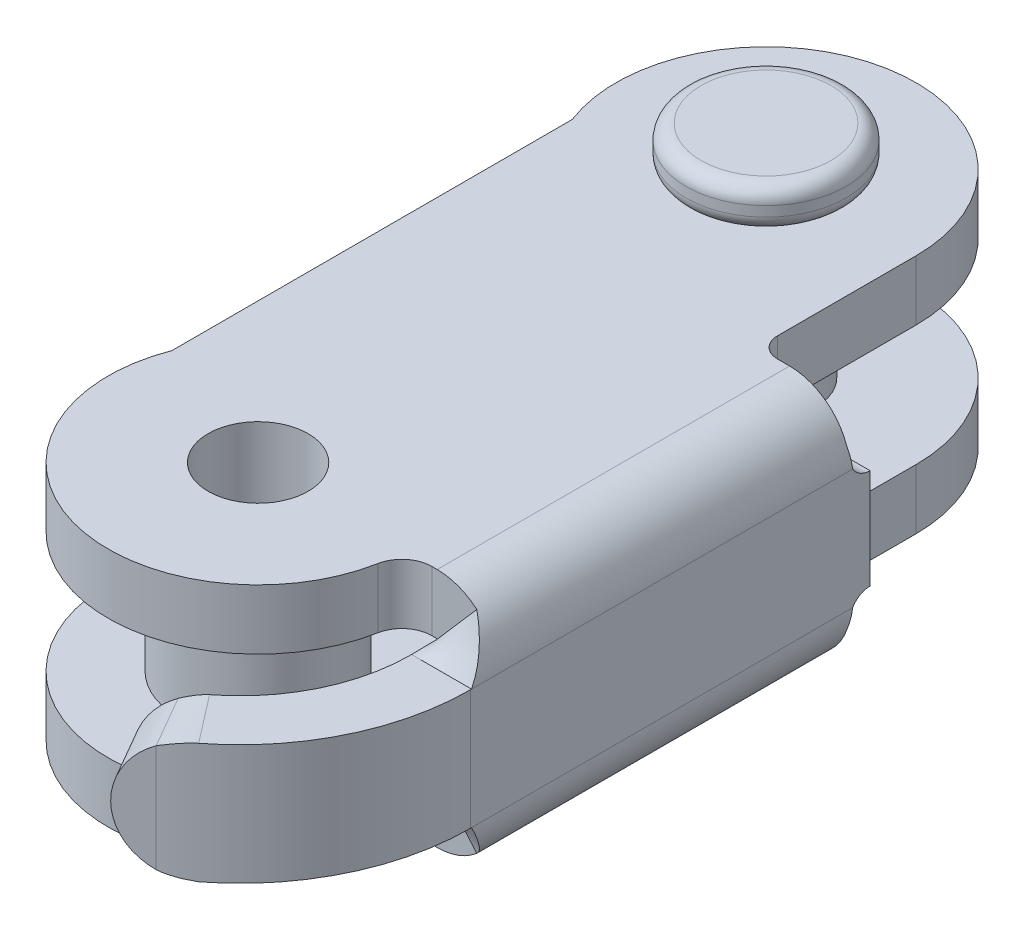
ISO-10303-21;
HEADER;
FILE_DESCRIPTION(('STEP AP214'),'2;1');
FILE_NAME('part.step','',(''),(''),'','','');
FILE_SCHEMA(('AUTOMOTIVE_DESIGN { 1 0 10303 214 1 1 1 1 }'));
ENDSEC;
DATA;
#1=APPLICATION_CONTEXT('core data for automotive mechanical design processes');
#2=APPLICATION_PROTOCOL_DEFINITION('international standard','automotive_design',2000,#1);
#3=PRODUCT_CONTEXT('',#1,'mechanical');
#4=PRODUCT('Part','Part','',(#3));
#5=PRODUCT_RELATED_PRODUCT_CATEGORY('part','',(#4));
#6=PRODUCT_DEFINITION_FORMATION('','',#4);
#7=PRODUCT_DEFINITION_CONTEXT('part definition',#1,'design');
#8=PRODUCT_DEFINITION('design','',#6,#7);
#9=PRODUCT_DEFINITION_SHAPE('','',#8);
#10=(LENGTH_UNIT() NAMED_UNIT(*) SI_UNIT(.MILLI.,.METRE.));
#11=(NAMED_UNIT(*) PLANE_ANGLE_UNIT() SI_UNIT($,.RADIAN.));
#12=(NAMED_UNIT(*) SI_UNIT($,.STERADIAN.) SOLID_ANGLE_UNIT());
#13=UNCERTAINTY_MEASURE_WITH_UNIT(LENGTH_MEASURE(1.E-05),#10,'distance_accuracy_value','');
#14=(GEOMETRIC_REPRESENTATION_CONTEXT(3) GLOBAL_UNCERTAINTY_ASSIGNED_CONTEXT((#13)) GLOBAL_UNIT_ASSIGNED_CONTEXT((#10,
#11,#12)) REPRESENTATION_CONTEXT('',''));
#15=CARTESIAN_POINT('',(0.,0.,0.));
#16=DIRECTION('',(0.,0.,1.));
#17=DIRECTION('',(1.,0.,0.));
#18=AXIS2_PLACEMENT_3D('',#15,#16,#17);
#19=CARTESIAN_POINT('',(-8.89664545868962,-8.01999999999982,-0.893708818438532));
#20=DIRECTION('',(0.,1.,0.));
#21=DIRECTION('',(-0.0999515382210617,0.,0.99499230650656));
#22=AXIS2_PLACEMENT_3D('',#19,#20,#21);
#23=PLANE('',#22);
#24=CARTESIAN_POINT('',(0.,-8.01999999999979,0.));
#25=DIRECTION('',(0.,-1.,0.));
#26=DIRECTION('',(-0.0999515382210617,0.,0.99499230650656));
#27=AXIS2_PLACEMENT_3D('',#24,#25,#26);
#28=CIRCLE('',#27,3.25);
#29=CARTESIAN_POINT('',(-0.324842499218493,-8.01999999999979,3.23372499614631));
#30=VERTEX_POINT('',#29);
#31=EDGE_CURVE('E1387',#30,#30,#28,.T.);
#32=ORIENTED_EDGE('',*,*,#31,.T.);
#33=EDGE_LOOP('',(#32));
#34=FACE_BOUND('',#33,.T.);
#35=ADVANCED_FACE('F14',(#34),#23,.F.);
#36=CARTESIAN_POINT('',(0.,-7.26999999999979,0.));
#37=DIRECTION('',(0.,1.,0.));
#38=DIRECTION('',(-0.0999515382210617,0.,0.99499230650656));
#39=AXIS2_PLACEMENT_3D('',#36,#37,#38);
#40=TOROIDAL_SURFACE('',#39,3.25,0.75);
#41=CARTESIAN_POINT('',(0.,-7.26999999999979,0.));
#42=DIRECTION('',(0.,1.,0.));
#43=DIRECTION('',(-0.0999515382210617,0.,0.99499230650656));
#44=AXIS2_PLACEMENT_3D('',#41,#42,#43);
#45=CIRCLE('',#44,4.);
#46=CARTESIAN_POINT('',(-0.399806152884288,-7.26999999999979,3.97996922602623));
#47=VERTEX_POINT('',#46);
#48=EDGE_CURVE('E1392',#47,#47,#45,.T.);
#49=ORIENTED_EDGE('',*,*,#48,.F.);
#50=EDGE_LOOP('',(#49));
#51=FACE_BOUND('',#50,.T.);
#52=ORIENTED_EDGE('',*,*,#31,.F.);
#53=EDGE_LOOP('',(#52));
#54=FACE_BOUND('',#53,.T.);
#55=ADVANCED_FACE('F1344',(#51,#54),#40,.T.);
#56=CARTESIAN_POINT('',(0.,-6.01999999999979,0.));
#57=DIRECTION('',(0.,-1.,0.));
#58=DIRECTION('',(0.0999515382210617,0.,-0.99499230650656));
#59=AXIS2_PLACEMENT_3D('',#56,#57,#58);
#60=CYLINDRICAL_SURFACE('',#59,4.);
#61=ORIENTED_EDGE('',*,*,#48,.T.);
#62=EDGE_LOOP('',(#61));
#63=FACE_BOUND('',#62,.T.);
#64=CARTESIAN_POINT('',(0.,-6.76999999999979,0.));
#65=DIRECTION('',(0.,-1.,0.));
#66=DIRECTION('',(-0.0999515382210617,0.,0.99499230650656));
#67=AXIS2_PLACEMENT_3D('',#64,#65,#66);
#68=CIRCLE('',#67,4.);
#69=CARTESIAN_POINT('',(-0.399806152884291,-6.76999999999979,3.97996922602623));
#70=VERTEX_POINT('',#69);
#71=EDGE_CURVE('E1381',#70,#70,#68,.T.);
#72=ORIENTED_EDGE('',*,*,#71,.T.);
#73=EDGE_LOOP('',(#72));
#74=FACE_BOUND('',#73,.T.);
#75=ADVANCED_FACE('F1347',(#63,#74),#60,.T.);
#76=CARTESIAN_POINT('',(0.,-6.76999999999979,0.));
#77=DIRECTION('',(0.,1.,0.));
#78=DIRECTION('',(-0.0999515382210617,0.,0.99499230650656));
#79=AXIS2_PLACEMENT_3D('',#76,#77,#78);
#80=TOROIDAL_SURFACE('',#79,3.25,0.75);
#81=CARTESIAN_POINT('',(0.,-6.01999999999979,0.));
#82=DIRECTION('',(0.,1.,0.));
#83=DIRECTION('',(-0.0999515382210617,0.,0.99499230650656));
#84=AXIS2_PLACEMENT_3D('',#81,#82,#83);
#85=CIRCLE('',#84,3.25);
#86=CARTESIAN_POINT('',(-0.324842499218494,-6.01999999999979,3.23372499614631));
#87=VERTEX_POINT('',#86);
#88=EDGE_CURVE('E1388',#87,#87,#85,.T.);
#89=ORIENTED_EDGE('',*,*,#88,.F.);
#90=EDGE_LOOP('',(#89));
#91=FACE_BOUND('',#90,.T.);
#92=ORIENTED_EDGE('',*,*,#71,.F.);
#93=EDGE_LOOP('',(#92));
#94=FACE_BOUND('',#93,.T.);
#95=ADVANCED_FACE('F1334',(#91,#94),#80,.T.);
#96=CARTESIAN_POINT('',(0.,8.02000000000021,0.));
#97=DIRECTION('',(0.,-1.,0.));
#98=DIRECTION('',(0.0999515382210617,0.,-0.99499230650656));
#99=AXIS2_PLACEMENT_3D('',#96,#97,#98);
#100=CYLINDRICAL_SURFACE('',#99,2.5);
#101=CARTESIAN_POINT('',(0.,-3.01999999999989,0.));
#102=DIRECTION('',(0.,1.,0.));
#103=DIRECTION('',(-0.998245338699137,0.,-0.0592135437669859));
#104=AXIS2_PLACEMENT_3D('',#101,#102,#103);
#105=CIRCLE('',#104,2.5);
#106=CARTESIAN_POINT('',(-2.49561334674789,-3.01999999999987,-0.148033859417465));
#107=VERTEX_POINT('',#106);
#108=EDGE_CURVE('E24',#107,#107,#105,.F.);
#109=ORIENTED_EDGE('',*,*,#108,.F.);
#110=EDGE_LOOP('',(#109));
#111=FACE_BOUND('',#110,.T.);
#112=CARTESIAN_POINT('',(0.,3.02,0.));
#113=DIRECTION('',(0.,-1.,0.));
#114=DIRECTION('',(0.998245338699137,0.,0.0592135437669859));
#115=AXIS2_PLACEMENT_3D('',#112,#113,#114);
#116=CIRCLE('',#115,2.5);
#117=CARTESIAN_POINT('',(2.49561334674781,3.02,0.148033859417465));
#118=VERTEX_POINT('',#117);
#119=EDGE_CURVE('E9',#118,#118,#116,.F.);
#120=ORIENTED_EDGE('',*,*,#119,.F.);
#121=EDGE_LOOP('',(#120));
#122=FACE_BOUND('',#121,.T.);
#123=ADVANCED_FACE('F1331',(#111,#122),#100,.T.);
#124=CARTESIAN_POINT('',(-8.89664545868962,8.0200000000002,-0.893708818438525));
#125=DIRECTION('',(0.,1.,0.));
#126=DIRECTION('',(-0.0999515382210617,0.,0.99499230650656));
#127=AXIS2_PLACEMENT_3D('',#124,#125,#126);
#128=PLANE('',#127);
#129=CARTESIAN_POINT('',(0.,8.02000000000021,0.));
#130=DIRECTION('',(0.,1.,0.));
#131=DIRECTION('',(-0.0999515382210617,0.,0.99499230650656));
#132=AXIS2_PLACEMENT_3D('',#129,#130,#131);
#133=CIRCLE('',#132,3.25);
#134=CARTESIAN_POINT('',(-0.324842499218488,8.02000000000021,3.23372499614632));
#135=VERTEX_POINT('',#134);
#136=EDGE_CURVE('E796',#135,#135,#133,.T.);
#137=ORIENTED_EDGE('',*,*,#136,.T.);
#138=EDGE_LOOP('',(#137));
#139=FACE_BOUND('',#138,.T.);
#140=ADVANCED_FACE('F923',(#139),#128,.T.);
#141=CARTESIAN_POINT('',(0.,7.27000000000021,0.));
#142=DIRECTION('',(0.,1.,0.));
#143=DIRECTION('',(-0.0999515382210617,0.,0.99499230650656));
#144=AXIS2_PLACEMENT_3D('',#141,#142,#143);
#145=TOROIDAL_SURFACE('',#144,3.25,0.75);
#146=ORIENTED_EDGE('',*,*,#136,.F.);
#147=EDGE_LOOP('',(#146));
#148=FACE_BOUND('',#147,.T.);
#149=CARTESIAN_POINT('',(0.,7.27000000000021,0.));
#150=DIRECTION('',(0.,-1.,0.));
#151=DIRECTION('',(-0.0999515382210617,0.,0.99499230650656));
#152=AXIS2_PLACEMENT_3D('',#149,#150,#151);
#153=CIRCLE('',#152,4.);
#154=CARTESIAN_POINT('',(-0.399806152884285,7.27000000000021,3.97996922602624));
#155=VERTEX_POINT('',#154);
#156=EDGE_CURVE('E1369',#155,#155,#153,.T.);
#157=ORIENTED_EDGE('',*,*,#156,.F.);
#158=EDGE_LOOP('',(#157));
#159=FACE_BOUND('',#158,.T.);
#160=ADVANCED_FACE('F1338',(#148,#159),#145,.T.);
#161=CARTESIAN_POINT('',(0.,6.02000000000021,0.));
#162=DIRECTION('',(0.,1.,0.));
#163=DIRECTION('',(-0.0999515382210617,0.,0.99499230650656));
#164=AXIS2_PLACEMENT_3D('',#161,#162,#163);
#165=CYLINDRICAL_SURFACE('',#164,4.);
#166=ORIENTED_EDGE('',*,*,#156,.T.);
#167=EDGE_LOOP('',(#166));
#168=FACE_BOUND('',#167,.T.);
#169=CARTESIAN_POINT('',(0.,6.77000000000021,0.));
#170=DIRECTION('',(0.,1.,0.));
#171=DIRECTION('',(0.0999515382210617,0.,-0.99499230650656));
#172=AXIS2_PLACEMENT_3D('',#169,#170,#171);
#173=CIRCLE('',#172,4.);
#174=CARTESIAN_POINT('',(0.399806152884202,6.77000000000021,-3.97996922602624));
#175=VERTEX_POINT('',#174);
#176=EDGE_CURVE('E1372',#175,#175,#173,.T.);
#177=ORIENTED_EDGE('',*,*,#176,.T.);
#178=EDGE_LOOP('',(#177));
#179=FACE_BOUND('',#178,.T.);
#180=ADVANCED_FACE('F1342',(#168,#179),#165,.T.);
#181=CARTESIAN_POINT('',(0.,6.77000000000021,0.));
#182=DIRECTION('',(0.,-1.,0.));
#183=DIRECTION('',(0.0999515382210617,0.,-0.99499230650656));
#184=AXIS2_PLACEMENT_3D('',#181,#182,#183);
#185=TOROIDAL_SURFACE('',#184,3.25,0.75);
#186=CARTESIAN_POINT('',(0.,6.02000000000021,0.));
#187=DIRECTION('',(0.,-1.,0.));
#188=DIRECTION('',(0.0999515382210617,0.,-0.99499230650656));
#189=AXIS2_PLACEMENT_3D('',#186,#187,#188);
#190=CIRCLE('',#189,3.25);
#191=CARTESIAN_POINT('',(0.324842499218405,6.02000000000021,-3.23372499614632));
#192=VERTEX_POINT('',#191);
#193=EDGE_CURVE('E1384',#192,#192,#190,.T.);
#194=ORIENTED_EDGE('',*,*,#193,.F.);
#195=EDGE_LOOP('',(#194));
#196=FACE_BOUND('',#195,.T.);
#197=ORIENTED_EDGE('',*,*,#176,.F.);
#198=EDGE_LOOP('',(#197));
#199=FACE_BOUND('',#198,.T.);
#200=ADVANCED_FACE('F850',(#196,#199),#185,.T.);
#201=CARTESIAN_POINT('',(6.03633547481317,0.,33.6134641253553));
#202=DIRECTION('',(0.5,0.,0.866025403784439));
#203=DIRECTION('',(0.,1.,0.));
#204=AXIS2_PLACEMENT_3D('',#201,#202,#203);
#205=CYLINDRICAL_SURFACE('',#204,3.00000000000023);
#206=CARTESIAN_POINT('',(6.03633547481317,0.,33.6134641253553));
#207=DIRECTION('',(-0.5,0.,-0.866025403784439));
#208=DIRECTION('',(0.,-1.,0.));
#209=AXIS2_PLACEMENT_3D('',#206,#207,#208);
#210=CIRCLE('',#209,3.00000000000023);
#211=CARTESIAN_POINT('',(4.88240216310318,-2.68785860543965,34.2796878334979));
#212=VERTEX_POINT('',#211);
#213=CARTESIAN_POINT('',(4.88240216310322,2.68785860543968,34.2796878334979));
#214=VERTEX_POINT('',#213);
#215=EDGE_CURVE('E271',#212,#214,#210,.T.);
#216=ORIENTED_EDGE('',*,*,#215,.F.);
#217=CARTESIAN_POINT('',(4.88240216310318,-2.68785860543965,34.2796878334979));
#218=CARTESIAN_POINT('',(5.38240216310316,-2.68785860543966,35.1457132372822));
#219=CARTESIAN_POINT('',(5.88240216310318,-2.68785860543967,36.0117386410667));
#220=CARTESIAN_POINT('',(6.3824021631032,-2.68785860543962,36.8777640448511));
#221=(BOUNDED_CURVE() B_SPLINE_CURVE(3,(#217,#218,#219,#220),.UNSPECIFIED.,.F.,
.F.) B_SPLINE_CURVE_WITH_KNOTS((4,4),(0.,1.),
.UNSPECIFIED.) CURVE() GEOMETRIC_REPRESENTATION_ITEM() RATIONAL_B_SPLINE_CURVE((1.,1.,1.,1.)) REPRESENTATION_ITEM(''));
#222=CARTESIAN_POINT('',(6.3824021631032,-2.68785860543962,36.8777640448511));
#223=VERTEX_POINT('',#222);
#224=EDGE_CURVE('E228',#212,#223,#221,.T.);
#225=ORIENTED_EDGE('',*,*,#224,.T.);
#226=CARTESIAN_POINT('',(7.53633547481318,0.,36.2115403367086));
#227=DIRECTION('',(-0.5,0.,-0.866025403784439));
#228=DIRECTION('',(0.,-1.,0.));
#229=AXIS2_PLACEMENT_3D('',#226,#227,#228);
#230=CIRCLE('',#229,3.00000000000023);
#231=CARTESIAN_POINT('',(6.38240216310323,2.68785860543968,36.8777640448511));
#232=VERTEX_POINT('',#231);
#233=EDGE_CURVE('E338',#223,#232,#230,.T.);
#234=ORIENTED_EDGE('',*,*,#233,.T.);
#235=CARTESIAN_POINT('',(6.38240216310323,2.68785860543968,36.8777640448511));
#236=CARTESIAN_POINT('',(5.8824021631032,2.68785860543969,36.0117386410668));
#237=CARTESIAN_POINT('',(5.38240216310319,2.68785860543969,35.1457132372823));
#238=CARTESIAN_POINT('',(4.88240216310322,2.68785860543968,34.2796878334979));
#239=(BOUNDED_CURVE() B_SPLINE_CURVE(3,(#235,#236,#237,#238),.UNSPECIFIED.,.F.,
.F.) B_SPLINE_CURVE_WITH_KNOTS((4,4),(0.,1.),
.UNSPECIFIED.) CURVE() GEOMETRIC_REPRESENTATION_ITEM() RATIONAL_B_SPLINE_CURVE((1.,1.,1.,1.)) REPRESENTATION_ITEM(''));
#240=EDGE_CURVE('E331',#232,#214,#239,.T.);
#241=ORIENTED_EDGE('',*,*,#240,.T.);
#242=EDGE_LOOP('',(#216,#225,#234,#241));
#243=FACE_BOUND('',#242,.T.);
#244=ADVANCED_FACE('F847',(#243),#205,.T.);
#245=CARTESIAN_POINT('',(14.0037691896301,-4.30000000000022,29.0134641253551));
#246=DIRECTION('',(-0.5,0.,-0.866025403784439));
#247=DIRECTION('',(0.,1.,0.));
#248=AXIS2_PLACEMENT_3D('',#245,#246,#247);
#249=PLANE('',#248);
#250=DIRECTION('',(0.,1.,0.));
#251=VECTOR('',#250,1.);
#252=CARTESIAN_POINT('',(4.88240216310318,-4.30000000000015,34.2796878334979));
#253=LINE('',#252,#251);
#254=EDGE_CURVE('E237',#212,#214,#253,.T.);
#255=ORIENTED_EDGE('',*,*,#254,.F.);
#256=ORIENTED_EDGE('',*,*,#215,.T.);
#257=EDGE_LOOP('',(#255,#256));
#258=FACE_BOUND('',#257,.T.);
#259=ADVANCED_FACE('F835',(#258),#249,.T.);
#260=CARTESIAN_POINT('',(7.65453451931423,-3.00000000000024,36.0255931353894));
#261=CARTESIAN_POINT('',(7.14490625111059,-2.94564758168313,36.4185468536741));
#262=CARTESIAN_POINT('',(6.70959730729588,-2.84147692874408,36.688857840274));
#263=CARTESIAN_POINT('',(6.3824021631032,-2.68785860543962,36.8777640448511));
#264=CARTESIAN_POINT('',(5.8226739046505,-3.00000000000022,33.6498223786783));
#265=CARTESIAN_POINT('',(5.44596849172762,-2.94564416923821,33.9402846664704));
#266=CARTESIAN_POINT('',(5.12428152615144,-2.84150200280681,34.1400387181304));
#267=CARTESIAN_POINT('',(4.88240216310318,-2.68785860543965,34.2796878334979));
#268=(BOUNDED_SURFACE() B_SPLINE_SURFACE(1,3,((#260,#261,#262,#263),(#264,#265,#266,#267)),
.UNSPECIFIED.,.F.,.F.,.F.) B_SPLINE_SURFACE_WITH_KNOTS((2,2),(4,4),(0.,1.),(0.,1.),
.UNSPECIFIED.) GEOMETRIC_REPRESENTATION_ITEM() RATIONAL_B_SPLINE_SURFACE(((1.,1.,1.,1.),(1.,1.,
1.,1.))) REPRESENTATION_ITEM('') SURFACE());
#269=CARTESIAN_POINT('',(7.65453451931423,-3.00000000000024,36.0255931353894));
#270=CARTESIAN_POINT('',(7.04391431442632,-3.00000000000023,35.233669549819));
#271=CARTESIAN_POINT('',(6.43329410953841,-3.00000000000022,34.4417459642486));
#272=CARTESIAN_POINT('',(5.8226739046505,-3.00000000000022,33.6498223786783));
#273=(BOUNDED_CURVE() B_SPLINE_CURVE(3,(#269,#270,#271,#272),.UNSPECIFIED.,.F.,
.F.) B_SPLINE_CURVE_WITH_KNOTS((4,4),(0.,1.),
.UNSPECIFIED.) CURVE() GEOMETRIC_REPRESENTATION_ITEM() RATIONAL_B_SPLINE_CURVE((1.,1.,1.,1.)) REPRESENTATION_ITEM(''));
#274=CARTESIAN_POINT('',(7.65453451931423,-3.00000000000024,36.0255931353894));
#275=VERTEX_POINT('',#274);
#276=CARTESIAN_POINT('',(5.8226739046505,-3.00000000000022,33.6498223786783));
#277=VERTEX_POINT('',#276);
#278=EDGE_CURVE('E225',#275,#277,#273,.T.);
#279=CARTESIAN_POINT('',(7.65453451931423,-3.00000000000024,36.0255931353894));
#280=CARTESIAN_POINT('',(7.14490625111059,-2.94564758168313,36.4185468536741));
#281=CARTESIAN_POINT('',(6.70959730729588,-2.84147692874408,36.688857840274));
#282=CARTESIAN_POINT('',(6.3824021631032,-2.68785860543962,36.8777640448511));
#283=(BOUNDED_CURVE() B_SPLINE_CURVE(3,(#279,#280,#281,#282),.UNSPECIFIED.,.F.,
.F.) B_SPLINE_CURVE_WITH_KNOTS((4,4),(0.,1.),
.UNSPECIFIED.) CURVE() GEOMETRIC_REPRESENTATION_ITEM() RATIONAL_B_SPLINE_CURVE((1.,1.,1.,1.)) REPRESENTATION_ITEM(''));
#284=EDGE_CURVE('E527',#275,#223,#283,.T.);
#285=CARTESIAN_POINT('',(4.88240216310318,-2.68785860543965,34.2796878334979));
#286=CARTESIAN_POINT('',(5.12428152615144,-2.84150200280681,34.1400387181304));
#287=CARTESIAN_POINT('',(5.44596849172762,-2.94564416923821,33.9402846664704));
#288=CARTESIAN_POINT('',(5.8226739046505,-3.00000000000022,33.6498223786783));
#289=(BOUNDED_CURVE() B_SPLINE_CURVE(3,(#285,#286,#287,#288),.UNSPECIFIED.,.F.,
.F.) B_SPLINE_CURVE_WITH_KNOTS((4,4),(0.,1.),
.UNSPECIFIED.) CURVE() GEOMETRIC_REPRESENTATION_ITEM() RATIONAL_B_SPLINE_CURVE((1.,1.,1.,1.)) REPRESENTATION_ITEM(''));
#290=EDGE_CURVE('E220',#277,#212,#289,.F.);
#291=ORIENTED_EDGE('',*,*,#278,.F.);
#292=ORIENTED_EDGE('',*,*,#284,.T.);
#293=ORIENTED_EDGE('',*,*,#224,.F.);
#294=ORIENTED_EDGE('',*,*,#290,.F.);
#295=EDGE_LOOP('',(#291,#292,#293,#294));
#296=FACE_BOUND('',#295,.T.);
#297=ADVANCED_FACE('F223',(#296),#268,.F.);
#298=CARTESIAN_POINT('',(15.5037691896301,-4.3000000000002,31.6115403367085));
#299=DIRECTION('',(-0.5,0.,-0.866025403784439));
#300=DIRECTION('',(0.,1.,0.));
#301=AXIS2_PLACEMENT_3D('',#298,#299,#300);
#302=PLANE('',#301);
#303=ORIENTED_EDGE('',*,*,#233,.F.);
#304=DIRECTION('',(0.,1.,0.));
#305=VECTOR('',#304,1.);
#306=CARTESIAN_POINT('',(6.38240216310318,-4.30000000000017,36.8777640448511));
#307=LINE('',#306,#305);
#308=EDGE_CURVE('E339',#223,#232,#307,.T.);
#309=ORIENTED_EDGE('',*,*,#308,.T.);
#310=EDGE_LOOP('',(#303,#309));
#311=FACE_BOUND('',#310,.T.);
#312=ADVANCED_FACE('F418',(#311),#302,.F.);
#313=CARTESIAN_POINT('',(6.38240216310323,2.68785860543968,36.8777640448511));
#314=CARTESIAN_POINT('',(6.89569522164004,2.88687202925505,36.5814141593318));
#315=CARTESIAN_POINT('',(7.31506167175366,2.99090215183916,36.2873468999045));
#316=CARTESIAN_POINT('',(7.65453451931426,3.00000000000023,36.0255931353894));
#317=CARTESIAN_POINT('',(4.88240216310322,2.68785860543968,34.2796878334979));
#318=CARTESIAN_POINT('',(5.26178571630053,2.88686837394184,34.0606506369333));
#319=CARTESIAN_POINT('',(5.57176376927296,2.99090231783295,33.8432890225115));
#320=CARTESIAN_POINT('',(5.82267390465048,3.00000000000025,33.6498223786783));
#321=(BOUNDED_SURFACE() B_SPLINE_SURFACE(1,3,((#313,#314,#315,#316),(#317,#318,#319,#320)),
.UNSPECIFIED.,.F.,.F.,.F.) B_SPLINE_SURFACE_WITH_KNOTS((2,2),(4,4),(0.,1.),(0.,1.),
.UNSPECIFIED.) GEOMETRIC_REPRESENTATION_ITEM() RATIONAL_B_SPLINE_SURFACE(((1.,1.,1.,1.),(1.,1.,
1.,1.))) REPRESENTATION_ITEM('') SURFACE());
#322=CARTESIAN_POINT('',(6.38240216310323,2.68785860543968,36.8777640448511));
#323=CARTESIAN_POINT('',(6.89569522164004,2.88687202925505,36.5814141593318));
#324=CARTESIAN_POINT('',(7.31506167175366,2.99090215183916,36.2873468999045));
#325=CARTESIAN_POINT('',(7.65453451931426,3.00000000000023,36.0255931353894));
#326=(BOUNDED_CURVE() B_SPLINE_CURVE(3,(#322,#323,#324,#325),.UNSPECIFIED.,.F.,
.F.) B_SPLINE_CURVE_WITH_KNOTS((4,4),(0.,1.),
.UNSPECIFIED.) CURVE() GEOMETRIC_REPRESENTATION_ITEM() RATIONAL_B_SPLINE_CURVE((1.,1.,1.,1.)) REPRESENTATION_ITEM(''));
#327=CARTESIAN_POINT('',(7.65453451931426,3.00000000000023,36.0255931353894));
#328=VERTEX_POINT('',#327);
#329=EDGE_CURVE('E326',#232,#328,#326,.T.);
#330=CARTESIAN_POINT('',(7.65453451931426,3.00000000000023,36.0255931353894));
#331=CARTESIAN_POINT('',(5.82267390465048,3.00000000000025,33.6498223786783));
#332=(BOUNDED_CURVE() B_SPLINE_CURVE(1,(#330,#331),.UNSPECIFIED.,.F.,
.F.) B_SPLINE_CURVE_WITH_KNOTS((2,2),(0.,1.),
.UNSPECIFIED.) CURVE() GEOMETRIC_REPRESENTATION_ITEM() RATIONAL_B_SPLINE_CURVE((1.,1.)) REPRESENTATION_ITEM(''));
#333=CARTESIAN_POINT('',(5.82267390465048,3.00000000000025,33.6498223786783));
#334=VERTEX_POINT('',#333);
#335=EDGE_CURVE('E316',#328,#334,#332,.T.);
#336=CARTESIAN_POINT('',(5.82267390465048,3.00000000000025,33.6498223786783));
#337=CARTESIAN_POINT('',(5.57176376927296,2.99090231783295,33.8432890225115));
#338=CARTESIAN_POINT('',(5.26178571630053,2.88686837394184,34.0606506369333));
#339=CARTESIAN_POINT('',(4.88240216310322,2.68785860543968,34.2796878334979));
#340=(BOUNDED_CURVE() B_SPLINE_CURVE(3,(#336,#337,#338,#339),.UNSPECIFIED.,.F.,
.F.) B_SPLINE_CURVE_WITH_KNOTS((4,4),(0.,1.),
.UNSPECIFIED.) CURVE() GEOMETRIC_REPRESENTATION_ITEM() RATIONAL_B_SPLINE_CURVE((1.,1.,1.,1.)) REPRESENTATION_ITEM(''));
#341=EDGE_CURVE('E268',#214,#334,#340,.F.);
#342=ORIENTED_EDGE('',*,*,#240,.F.);
#343=ORIENTED_EDGE('',*,*,#329,.T.);
#344=ORIENTED_EDGE('',*,*,#335,.T.);
#345=ORIENTED_EDGE('',*,*,#341,.F.);
#346=EDGE_LOOP('',(#342,#343,#344,#345));
#347=FACE_BOUND('',#346,.T.);
#348=ADVANCED_FACE('F296',(#347),#321,.F.);
#349=CARTESIAN_POINT('',(0.632402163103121,-12.4363286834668,26.9184719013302));
#350=DIRECTION('',(0.,1.,0.));
#351=DIRECTION('',(-1.,0.,0.));
#352=AXIS2_PLACEMENT_3D('',#349,#350,#351);
#353=CYLINDRICAL_SURFACE('',#352,8.5);
#354=DIRECTION('',(0.,1.,0.));
#355=VECTOR('',#354,1.);
#356=CARTESIAN_POINT('',(9.13240216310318,-4.3000000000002,26.9184719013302));
#357=LINE('',#356,#355);
#358=CARTESIAN_POINT('',(9.13240216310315,-3.00000000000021,26.9184719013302));
#359=VERTEX_POINT('',#358);
#360=CARTESIAN_POINT('',(9.13240216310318,3.00000000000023,26.9184719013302));
#361=VERTEX_POINT('',#360);
#362=EDGE_CURVE('E255',#359,#361,#357,.T.);
#363=ORIENTED_EDGE('',*,*,#362,.F.);
#364=CARTESIAN_POINT('',(0.632402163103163,-3.00000000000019,26.9184719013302));
#365=DIRECTION('',(0.,-1.,0.));
#366=DIRECTION('',(1.,0.,0.));
#367=AXIS2_PLACEMENT_3D('',#364,#365,#366);
#368=CIRCLE('',#367,8.5);
#369=EDGE_CURVE('E236',#359,#277,#368,.T.);
#370=ORIENTED_EDGE('',*,*,#369,.T.);
#371=ORIENTED_EDGE('',*,*,#290,.T.);
#372=ORIENTED_EDGE('',*,*,#254,.T.);
#373=ORIENTED_EDGE('',*,*,#341,.T.);
#374=CARTESIAN_POINT('',(0.632402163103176,3.00000000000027,26.9184719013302));
#375=DIRECTION('',(0.,1.,0.));
#376=DIRECTION('',(-1.,0.,0.));
#377=AXIS2_PLACEMENT_3D('',#374,#375,#376);
#378=CIRCLE('',#377,8.5);
#379=EDGE_CURVE('E433',#334,#361,#378,.T.);
#380=ORIENTED_EDGE('',*,*,#379,.T.);
#381=EDGE_LOOP('',(#363,#370,#371,#372,#373,#380));
#382=FACE_BOUND('',#381,.T.);
#383=ADVANCED_FACE('F252',(#382),#353,.F.);
#384=CARTESIAN_POINT('',(9.13240216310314,-3.00000000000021,26.8579999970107));
#385=DIRECTION('',(0.,1.,0.));
#386=DIRECTION('',(-1.,0.,0.));
#387=AXIS2_PLACEMENT_3D('',#384,#385,#386);
#388=PLANE('',#387);
#389=DIRECTION('',(0.,0.,1.));
#390=VECTOR('',#389,1.);
#391=CARTESIAN_POINT('',(12.1324021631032,-3.00000000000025,26.8579999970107));
#392=LINE('',#391,#390);
#393=CARTESIAN_POINT('',(12.1324021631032,-3.00000000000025,26.8579999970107));
#394=VERTEX_POINT('',#393);
#395=CARTESIAN_POINT('',(12.1324021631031,-3.00000000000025,26.9184719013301));
#396=VERTEX_POINT('',#395);
#397=EDGE_CURVE('E889',#394,#396,#392,.T.);
#398=ORIENTED_EDGE('',*,*,#397,.T.);
#399=CARTESIAN_POINT('',(0.632402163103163,-3.00000000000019,26.9184719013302));
#400=DIRECTION('',(0.,-1.,0.));
#401=DIRECTION('',(-1.,0.,0.));
#402=AXIS2_PLACEMENT_3D('',#399,#400,#401);
#403=CIRCLE('',#402,11.5);
#404=EDGE_CURVE('E248',#396,#275,#403,.T.);
#405=ORIENTED_EDGE('',*,*,#404,.T.);
#406=ORIENTED_EDGE('',*,*,#278,.T.);
#407=ORIENTED_EDGE('',*,*,#369,.F.);
#408=DIRECTION('',(0.,0.,1.));
#409=VECTOR('',#408,1.);
#410=CARTESIAN_POINT('',(9.13240216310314,-3.00000000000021,26.8579999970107));
#411=LINE('',#410,#409);
#412=CARTESIAN_POINT('',(9.13240216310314,-3.00000000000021,26.8579999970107));
#413=VERTEX_POINT('',#412);
#414=EDGE_CURVE('E1298',#413,#359,#411,.T.);
#415=ORIENTED_EDGE('',*,*,#414,.F.);
#416=CARTESIAN_POINT('',(9.13240216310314,-3.00000000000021,26.8579999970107));
#417=CARTESIAN_POINT('',(10.1324021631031,-3.00000000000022,26.8579999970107));
#418=CARTESIAN_POINT('',(11.1324021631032,-3.00000000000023,26.8579999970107));
#419=CARTESIAN_POINT('',(12.1324021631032,-3.00000000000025,26.8579999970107));
#420=(BOUNDED_CURVE() B_SPLINE_CURVE(3,(#416,#417,#418,#419),.UNSPECIFIED.,.F.,
.F.) B_SPLINE_CURVE_WITH_KNOTS((4,4),(0.,1.),
.UNSPECIFIED.) CURVE() GEOMETRIC_REPRESENTATION_ITEM() RATIONAL_B_SPLINE_CURVE((1.,1.,1.,1.)) REPRESENTATION_ITEM(''));
#421=EDGE_CURVE('E964',#413,#394,#420,.T.);
#422=ORIENTED_EDGE('',*,*,#421,.T.);
#423=EDGE_LOOP('',(#398,#405,#406,#407,#415,#422));
#424=FACE_BOUND('',#423,.T.);
#425=ADVANCED_FACE('F244',(#424),#388,.F.);
#426=CARTESIAN_POINT('',(0.632402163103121,-12.4363286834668,26.9184719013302));
#427=DIRECTION('',(0.,1.,0.));
#428=DIRECTION('',(-1.,0.,0.));
#429=AXIS2_PLACEMENT_3D('',#426,#427,#428);
#430=CYLINDRICAL_SURFACE('',#429,11.5);
#431=DIRECTION('',(0.,1.,0.));
#432=VECTOR('',#431,1.);
#433=CARTESIAN_POINT('',(12.1324021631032,-4.3000000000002,26.9184719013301));
#434=LINE('',#433,#432);
#435=CARTESIAN_POINT('',(12.1324021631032,3.00000000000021,26.9184719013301));
#436=VERTEX_POINT('',#435);
#437=EDGE_CURVE('E275',#396,#436,#434,.T.);
#438=ORIENTED_EDGE('',*,*,#437,.T.);
#439=CARTESIAN_POINT('',(0.632402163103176,3.00000000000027,26.9184719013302));
#440=DIRECTION('',(0.,1.,0.));
#441=DIRECTION('',(-1.,0.,0.));
#442=AXIS2_PLACEMENT_3D('',#439,#440,#441);
#443=CIRCLE('',#442,11.5);
#444=EDGE_CURVE('E312',#328,#436,#443,.T.);
#445=ORIENTED_EDGE('',*,*,#444,.F.);
#446=ORIENTED_EDGE('',*,*,#329,.F.);
#447=ORIENTED_EDGE('',*,*,#308,.F.);
#448=ORIENTED_EDGE('',*,*,#284,.F.);
#449=ORIENTED_EDGE('',*,*,#404,.F.);
#450=EDGE_LOOP('',(#438,#445,#446,#447,#448,#449));
#451=FACE_BOUND('',#450,.T.);
#452=ADVANCED_FACE('F345',(#451),#430,.T.);
#453=CARTESIAN_POINT('',(9.13240216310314,3.49999999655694,6.93279998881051));
#454=DIRECTION('',(1.,0.,0.));
#455=DIRECTION('',(0.,1.,0.));
#456=AXIS2_PLACEMENT_3D('',#453,#454,#455);
#457=CYLINDRICAL_SURFACE('',#456,1.);
#458=CARTESIAN_POINT('',(9.13240216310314,3.49999999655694,6.93279998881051));
#459=DIRECTION('',(1.,0.,0.));
#460=DIRECTION('',(0.,-1.,0.));
#461=AXIS2_PLACEMENT_3D('',#458,#459,#460);
#462=CIRCLE('',#461,1.);
#463=CARTESIAN_POINT('',(9.13240216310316,3.,7.79882539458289));
#464=VERTEX_POINT('',#463);
#465=CARTESIAN_POINT('',(9.13240216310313,2.49999999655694,6.93279998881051));
#466=VERTEX_POINT('',#465);
#467=EDGE_CURVE('E710',#464,#466,#462,.T.);
#468=ORIENTED_EDGE('',*,*,#467,.F.);
#469=CARTESIAN_POINT('',(9.13240216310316,3.,7.79882539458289));
#470=CARTESIAN_POINT('',(10.1324021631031,3.,7.79882539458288));
#471=CARTESIAN_POINT('',(11.1324021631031,3.,7.79882539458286));
#472=CARTESIAN_POINT('',(12.1324021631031,3.,7.79882539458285));
#473=(BOUNDED_CURVE() B_SPLINE_CURVE(3,(#469,#470,#471,#472),.UNSPECIFIED.,.F.,
.F.) B_SPLINE_CURVE_WITH_KNOTS((4,4),(0.,1.),
.UNSPECIFIED.) CURVE() GEOMETRIC_REPRESENTATION_ITEM() RATIONAL_B_SPLINE_CURVE((1.,1.,1.,1.)) REPRESENTATION_ITEM(''));
#474=CARTESIAN_POINT('',(12.1324021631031,3.,7.79882539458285));
#475=VERTEX_POINT('',#474);
#476=EDGE_CURVE('E972',#464,#475,#473,.T.);
#477=ORIENTED_EDGE('',*,*,#476,.T.);
#478=CARTESIAN_POINT('',(12.1324021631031,3.49999999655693,6.93279998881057));
#479=DIRECTION('',(1.,0.,0.));
#480=DIRECTION('',(0.,-1.,0.));
#481=AXIS2_PLACEMENT_3D('',#478,#479,#480);
#482=CIRCLE('',#481,1.);
#483=CARTESIAN_POINT('',(12.1324021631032,2.49999999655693,6.93279998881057));
#484=VERTEX_POINT('',#483);
#485=EDGE_CURVE('E968',#475,#484,#482,.T.);
#486=ORIENTED_EDGE('',*,*,#485,.T.);
#487=DIRECTION('',(1.,0.,0.));
#488=VECTOR('',#487,1.);
#489=CARTESIAN_POINT('',(9.13240216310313,2.49999999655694,6.93279998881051));
#490=LINE('',#489,#488);
#491=EDGE_CURVE('E817',#466,#484,#490,.T.);
#492=ORIENTED_EDGE('',*,*,#491,.F.);
#493=EDGE_LOOP('',(#468,#477,#486,#492));
#494=FACE_BOUND('',#493,.T.);
#495=ADVANCED_FACE('F354',(#494),#457,.F.);
#496=CARTESIAN_POINT('',(9.13240216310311,-2.50000000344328,6.93279998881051));
#497=DIRECTION('',(0.,0.,1.));
#498=DIRECTION('',(0.,-1.,0.));
#499=AXIS2_PLACEMENT_3D('',#496,#497,#498);
#500=PLANE('',#499);
#501=DIRECTION('',(0.,-1.,0.));
#502=VECTOR('',#501,1.);
#503=CARTESIAN_POINT('',(12.1324021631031,-2.50000000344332,6.93279998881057));
#504=LINE('',#503,#502);
#505=CARTESIAN_POINT('',(12.1324021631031,-2.50000000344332,6.93279998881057));
#506=VERTEX_POINT('',#505);
#507=EDGE_CURVE('E812',#484,#506,#504,.T.);
#508=ORIENTED_EDGE('',*,*,#507,.T.);
#509=DIRECTION('',(1.,0.,0.));
#510=VECTOR('',#509,1.);
#511=CARTESIAN_POINT('',(9.13240216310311,-2.50000000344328,6.93279998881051));
#512=LINE('',#511,#510);
#513=CARTESIAN_POINT('',(9.13240216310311,-2.50000000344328,6.93279998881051));
#514=VERTEX_POINT('',#513);
#515=EDGE_CURVE('E526',#514,#506,#512,.T.);
#516=ORIENTED_EDGE('',*,*,#515,.F.);
#517=DIRECTION('',(0.,-1.,0.));
#518=VECTOR('',#517,1.);
#519=CARTESIAN_POINT('',(9.13240216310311,-2.50000000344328,6.93279998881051));
#520=LINE('',#519,#518);
#521=EDGE_CURVE('E996',#466,#514,#520,.T.);
#522=ORIENTED_EDGE('',*,*,#521,.F.);
#523=ORIENTED_EDGE('',*,*,#491,.T.);
#524=EDGE_LOOP('',(#508,#516,#522,#523));
#525=FACE_BOUND('',#524,.T.);
#526=ADVANCED_FACE('F16',(#525),#500,.F.);
#527=CARTESIAN_POINT('',(9.13240216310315,-3.50000000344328,6.93279998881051));
#528=DIRECTION('',(1.,0.,0.));
#529=DIRECTION('',(0.,1.,0.));
#530=AXIS2_PLACEMENT_3D('',#527,#528,#529);
#531=CYLINDRICAL_SURFACE('',#530,1.);
#532=CARTESIAN_POINT('',(9.1324021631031,-3.00000000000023,7.798825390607));
#533=CARTESIAN_POINT('',(12.1324021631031,-3.00000000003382,7.79882539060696));
#534=(BOUNDED_CURVE() B_SPLINE_CURVE(1,(#532,#533),.UNSPECIFIED.,.F.,
.F.) B_SPLINE_CURVE_WITH_KNOTS((2,2),(0.,1.),
.UNSPECIFIED.) CURVE() GEOMETRIC_REPRESENTATION_ITEM() RATIONAL_B_SPLINE_CURVE((1.,1.)) REPRESENTATION_ITEM(''));
#535=CARTESIAN_POINT('',(9.1324021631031,-3.00000000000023,7.798825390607));
#536=VERTEX_POINT('',#535);
#537=CARTESIAN_POINT('',(12.1324021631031,-3.00000000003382,7.79882539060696));
#538=VERTEX_POINT('',#537);
#539=EDGE_CURVE('E504',#536,#538,#534,.T.);
#540=ORIENTED_EDGE('',*,*,#539,.F.);
#541=CARTESIAN_POINT('',(9.13240216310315,-3.50000000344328,6.93279998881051));
#542=DIRECTION('',(1.,0.,0.));
#543=DIRECTION('',(0.,-1.,0.));
#544=AXIS2_PLACEMENT_3D('',#541,#542,#543);
#545=CIRCLE('',#544,1.);
#546=EDGE_CURVE('E1207',#514,#536,#545,.T.);
#547=ORIENTED_EDGE('',*,*,#546,.F.);
#548=ORIENTED_EDGE('',*,*,#515,.T.);
#549=CARTESIAN_POINT('',(12.1324021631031,-3.50000000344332,6.93279998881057));
#550=DIRECTION('',(1.,0.,0.));
#551=DIRECTION('',(0.,-1.,0.));
#552=AXIS2_PLACEMENT_3D('',#549,#550,#551);
#553=CIRCLE('',#552,1.);
#554=EDGE_CURVE('E519',#506,#538,#553,.T.);
#555=ORIENTED_EDGE('',*,*,#554,.T.);
#556=EDGE_LOOP('',(#540,#547,#548,#555));
#557=FACE_BOUND('',#556,.T.);
#558=ADVANCED_FACE('F663',(#557),#531,.F.);
#559=CARTESIAN_POINT('',(9.13240216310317,3.00000000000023,26.8579999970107));
#560=DIRECTION('',(0.,-1.,0.));
#561=DIRECTION('',(0.,0.,1.));
#562=AXIS2_PLACEMENT_3D('',#559,#560,#561);
#563=PLANE('',#562);
#564=DIRECTION('',(0.,0.,-1.));
#565=VECTOR('',#564,1.);
#566=CARTESIAN_POINT('',(9.13240216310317,3.00000000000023,26.8579999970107));
#567=LINE('',#566,#565);
#568=CARTESIAN_POINT('',(9.13240216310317,3.,26.8579999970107));
#569=VERTEX_POINT('',#568);
#570=EDGE_CURVE('E706',#361,#569,#567,.T.);
#571=ORIENTED_EDGE('',*,*,#570,.F.);
#572=ORIENTED_EDGE('',*,*,#379,.F.);
#573=ORIENTED_EDGE('',*,*,#335,.F.);
#574=ORIENTED_EDGE('',*,*,#444,.T.);
#575=DIRECTION('',(0.,0.,-1.));
#576=VECTOR('',#575,1.);
#577=CARTESIAN_POINT('',(12.1324021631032,3.00000000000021,26.8579999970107));
#578=LINE('',#577,#576);
#579=CARTESIAN_POINT('',(12.1324021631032,3.00000000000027,26.8579999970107));
#580=VERTEX_POINT('',#579);
#581=EDGE_CURVE('E816',#436,#580,#578,.T.);
#582=ORIENTED_EDGE('',*,*,#581,.T.);
#583=CARTESIAN_POINT('',(9.13240216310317,3.,26.8579999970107));
#584=CARTESIAN_POINT('',(12.1324021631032,3.00000000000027,26.8579999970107));
#585=(BOUNDED_CURVE() B_SPLINE_CURVE(1,(#583,#584),.UNSPECIFIED.,.F.,
.F.) B_SPLINE_CURVE_WITH_KNOTS((2,2),(0.,1.),
.UNSPECIFIED.) CURVE() GEOMETRIC_REPRESENTATION_ITEM() RATIONAL_B_SPLINE_CURVE((1.,1.)) REPRESENTATION_ITEM(''));
#586=EDGE_CURVE('E869',#569,#580,#585,.T.);
#587=ORIENTED_EDGE('',*,*,#586,.F.);
#588=EDGE_LOOP('',(#571,#572,#573,#574,#582,#587));
#589=FACE_BOUND('',#588,.T.);
#590=ADVANCED_FACE('F356',(#589),#563,.F.);
#591=CARTESIAN_POINT('',(9.13240216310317,-4.3000000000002,26.8579999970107));
#592=DIRECTION('',(-1.,0.,0.));
#593=DIRECTION('',(0.,-1.,0.));
#594=AXIS2_PLACEMENT_3D('',#591,#592,#593);
#595=PLANE('',#594);
#596=ORIENTED_EDGE('',*,*,#546,.T.);
#597=DIRECTION('',(0.,0.,1.));
#598=VECTOR('',#597,1.);
#599=CARTESIAN_POINT('',(9.13240216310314,-3.,26.8579999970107));
#600=LINE('',#599,#598);
#601=EDGE_CURVE('E1219',#536,#413,#600,.T.);
#602=ORIENTED_EDGE('',*,*,#601,.T.);
#603=ORIENTED_EDGE('',*,*,#414,.T.);
#604=ORIENTED_EDGE('',*,*,#362,.T.);
#605=ORIENTED_EDGE('',*,*,#570,.T.);
#606=DIRECTION('',(0.,0.,1.));
#607=VECTOR('',#606,1.);
#608=CARTESIAN_POINT('',(9.13240216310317,3.,26.8579999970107));
#609=LINE('',#608,#607);
#610=EDGE_CURVE('E694',#464,#569,#609,.T.);
#611=ORIENTED_EDGE('',*,*,#610,.F.);
#612=ORIENTED_EDGE('',*,*,#467,.T.);
#613=ORIENTED_EDGE('',*,*,#521,.T.);
#614=EDGE_LOOP('',(#596,#602,#603,#604,#605,#611,#612,#613));
#615=FACE_BOUND('',#614,.T.);
#616=ADVANCED_FACE('F297',(#615),#595,.T.);
#617=CARTESIAN_POINT('',(12.1324021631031,-3.00000000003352,7.79882539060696));
#618=CARTESIAN_POINT('',(12.1324021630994,-3.33124068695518,7.84349712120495));
#619=CARTESIAN_POINT('',(12.0774848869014,-3.66212146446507,7.88812825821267));
#620=CARTESIAN_POINT('',(11.9704785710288,-3.97560199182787,7.93279998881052));
#621=CARTESIAN_POINT('',(9.1324021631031,-3.00000000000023,7.798825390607));
#622=CARTESIAN_POINT('',(9.13240216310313,-3.00219298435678,7.84348362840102));
#623=CARTESIAN_POINT('',(9.13203825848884,-3.00438553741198,7.88814175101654));
#624=CARTESIAN_POINT('',(9.13132982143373,-3.00646094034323,7.93279998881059));
#625=(BOUNDED_SURFACE() B_SPLINE_SURFACE(1,3,((#617,#618,#619,#620),(#621,#622,#623,#624)),
.UNSPECIFIED.,.F.,.F.,.F.) B_SPLINE_SURFACE_WITH_KNOTS((2,2),(4,4),(0.,1.),(0.,1.),
.UNSPECIFIED.) GEOMETRIC_REPRESENTATION_ITEM() RATIONAL_B_SPLINE_SURFACE(((1.,1.,1.,1.),(1.,1.,
1.,1.))) REPRESENTATION_ITEM('') SURFACE());
#626=CARTESIAN_POINT('',(12.1324021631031,-3.00000000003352,7.79882539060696));
#627=CARTESIAN_POINT('',(12.1324021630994,-3.33124068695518,7.84349712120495));
#628=CARTESIAN_POINT('',(12.0774848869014,-3.66212146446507,7.88812825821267));
#629=CARTESIAN_POINT('',(11.9704785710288,-3.97560199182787,7.93279998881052));
#630=(BOUNDED_CURVE() B_SPLINE_CURVE(3,(#626,#627,#628,#629),.UNSPECIFIED.,.F.,
.F.) B_SPLINE_CURVE_WITH_KNOTS((4,4),(0.,1.),
.UNSPECIFIED.) CURVE() GEOMETRIC_REPRESENTATION_ITEM() RATIONAL_B_SPLINE_CURVE((1.,1.,1.,1.)) REPRESENTATION_ITEM(''));
#631=CARTESIAN_POINT('',(11.9704785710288,-3.97560199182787,7.93279998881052));
#632=VERTEX_POINT('',#631);
#633=EDGE_CURVE('E533',#538,#632,#630,.T.);
#634=CARTESIAN_POINT('',(11.9704785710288,-3.97560199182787,7.93279998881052));
#635=CARTESIAN_POINT('',(9.13132982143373,-3.00646094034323,7.93279998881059));
#636=(BOUNDED_CURVE() B_SPLINE_CURVE(1,(#634,#635),.UNSPECIFIED.,.F.,
.F.) B_SPLINE_CURVE_WITH_KNOTS((2,2),(0.,1.),
.UNSPECIFIED.) CURVE() GEOMETRIC_REPRESENTATION_ITEM() RATIONAL_B_SPLINE_CURVE((1.,1.)) REPRESENTATION_ITEM(''));
#637=CARTESIAN_POINT('',(9.13132982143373,-3.00646094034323,7.93279998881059));
#638=VERTEX_POINT('',#637);
#639=EDGE_CURVE('E513',#632,#638,#636,.T.);
#640=CARTESIAN_POINT('',(9.1324021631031,-3.00000000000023,7.798825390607));
#641=CARTESIAN_POINT('',(9.13240216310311,-3.00219298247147,7.84348359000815));
#642=CARTESIAN_POINT('',(9.1320382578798,-3.00438553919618,7.88814178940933));
#643=CARTESIAN_POINT('',(9.13132982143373,-3.00646094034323,7.93279998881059));
#644=(BOUNDED_CURVE() B_SPLINE_CURVE(3,(#640,#641,#642,#643),.UNSPECIFIED.,.F.,
.F.) B_SPLINE_CURVE_WITH_KNOTS((4,4),(0.,1.),
.UNSPECIFIED.) CURVE() GEOMETRIC_REPRESENTATION_ITEM() RATIONAL_B_SPLINE_CURVE((1.,1.,1.,1.)) REPRESENTATION_ITEM(''));
#645=EDGE_CURVE('E514',#536,#638,#644,.T.);
#646=ORIENTED_EDGE('',*,*,#633,.T.);
#647=ORIENTED_EDGE('',*,*,#639,.T.);
#648=ORIENTED_EDGE('',*,*,#645,.F.);
#649=ORIENTED_EDGE('',*,*,#539,.T.);
#650=EDGE_LOOP('',(#646,#647,#648,#649));
#651=FACE_BOUND('',#650,.T.);
#652=ADVANCED_FACE('F628',(#651),#625,.F.);
#653=CARTESIAN_POINT('',(9.11240216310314,-3.,25.5579999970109));
#654=DIRECTION('',(0.,0.,-1.));
#655=DIRECTION('',(1.,0.,0.));
#656=AXIS2_PLACEMENT_3D('',#653,#654,#655);
#657=PLANE('',#656);
#658=CARTESIAN_POINT('',(9.11240216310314,-3.,25.5579999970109));
#659=DIRECTION('',(0.,0.,1.));
#660=DIRECTION('',(-1.,0.,0.));
#661=AXIS2_PLACEMENT_3D('',#658,#659,#660);
#662=CIRCLE('',#661,0.02);
#663=CARTESIAN_POINT('',(9.11240216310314,-3.02,25.5579999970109));
#664=VERTEX_POINT('',#663);
#665=CARTESIAN_POINT('',(9.12552256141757,-3.0150948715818,25.5579999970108));
#666=VERTEX_POINT('',#665);
#667=EDGE_CURVE('E573',#664,#666,#662,.T.);
#668=ORIENTED_EDGE('',*,*,#667,.F.);
#669=DIRECTION('',(1.,0.,0.));
#670=VECTOR('',#669,1.);
#671=CARTESIAN_POINT('',(10.2000125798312,-3.02,25.5579999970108));
#672=LINE('',#671,#670);
#673=CARTESIAN_POINT('',(8.84596156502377,-3.02,25.5579999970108));
#674=VERTEX_POINT('',#673);
#675=EDGE_CURVE('E940',#674,#664,#672,.T.);
#676=ORIENTED_EDGE('',*,*,#675,.F.);
#677=DIRECTION('',(0.,-1.,0.));
#678=VECTOR('',#677,1.);
#679=CARTESIAN_POINT('',(8.84596156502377,-3.02,25.5579999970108));
#680=LINE('',#679,#678);
#681=CARTESIAN_POINT('',(8.84596156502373,-6.02,25.5579999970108));
#682=VERTEX_POINT('',#681);
#683=EDGE_CURVE('E770',#674,#682,#680,.T.);
#684=ORIENTED_EDGE('',*,*,#683,.T.);
#685=DIRECTION('',(1.,0.,0.));
#686=VECTOR('',#685,1.);
#687=CARTESIAN_POINT('',(10.2000125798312,-6.02,25.5579999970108));
#688=LINE('',#687,#686);
#689=CARTESIAN_POINT('',(9.11240216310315,-6.02,25.5579999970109));
#690=VERTEX_POINT('',#689);
#691=EDGE_CURVE('E766',#682,#690,#688,.T.);
#692=ORIENTED_EDGE('',*,*,#691,.T.);
#693=CARTESIAN_POINT('',(9.11240216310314,-3.,25.5579999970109));
#694=DIRECTION('',(0.,0.,1.));
#695=DIRECTION('',(0.,1.,0.));
#696=AXIS2_PLACEMENT_3D('',#693,#694,#695);
#697=CIRCLE('',#696,3.02);
#698=CARTESIAN_POINT('',(11.0935823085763,-5.27932560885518,25.5579999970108));
#699=VERTEX_POINT('',#698);
#700=EDGE_CURVE('E546',#690,#699,#697,.T.);
#701=ORIENTED_EDGE('',*,*,#700,.T.);
#702=CARTESIAN_POINT('',(11.0935823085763,-5.27932560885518,25.5579999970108));
#703=CARTESIAN_POINT('',(10.4375623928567,-4.52458202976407,25.5579999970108));
#704=CARTESIAN_POINT('',(9.78154247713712,-3.76983845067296,25.5579999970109));
#705=CARTESIAN_POINT('',(9.12552256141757,-3.0150948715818,25.5579999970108));
#706=(BOUNDED_CURVE() B_SPLINE_CURVE(3,(#702,#703,#704,#705),.UNSPECIFIED.,.F.,
.F.) B_SPLINE_CURVE_WITH_KNOTS((4,4),(0.,1.),
.UNSPECIFIED.) CURVE() GEOMETRIC_REPRESENTATION_ITEM() RATIONAL_B_SPLINE_CURVE((1.,1.,1.,1.)) REPRESENTATION_ITEM(''));
#707=EDGE_CURVE('E619',#699,#666,#706,.T.);
#708=ORIENTED_EDGE('',*,*,#707,.T.);
#709=EDGE_LOOP('',(#668,#676,#684,#692,#701,#708));
#710=FACE_BOUND('',#709,.T.);
#711=ADVANCED_FACE('F587',(#710),#657,.F.);
#712=CARTESIAN_POINT('',(11.0935823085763,-5.27932560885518,25.5579999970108));
#713=CARTESIAN_POINT('',(11.4185517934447,-4.99686351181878,25.7747104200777));
#714=CARTESIAN_POINT('',(11.6819244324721,-4.64416253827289,25.9913333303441));
#715=CARTESIAN_POINT('',(12.0389810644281,-3.86072706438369,26.4246666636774));
#716=CARTESIAN_POINT('',(12.1324021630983,-3.43056939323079,26.6412895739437));
#717=CARTESIAN_POINT('',(12.1324021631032,-3.000000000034,26.8579999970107));
#718=CARTESIAN_POINT('',(9.12552256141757,-3.0150948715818,25.5579999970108));
#719=CARTESIAN_POINT('',(9.127674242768,-3.013224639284,25.7746666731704));
#720=CARTESIAN_POINT('',(9.1294188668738,-3.01088849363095,25.9913333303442));
#721=CARTESIAN_POINT('',(9.13178348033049,-3.0057001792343,26.4246666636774));
#722=CARTESIAN_POINT('',(9.13240216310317,-3.0028508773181,26.6413333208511));
#723=CARTESIAN_POINT('',(9.13240216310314,-3.00000000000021,26.8579999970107));
#724=(BOUNDED_SURFACE() B_SPLINE_SURFACE(1,3,((#712,#713,#714,#715,#716,#717),(#718,#719,#720,
#721,#722,#723)),.UNSPECIFIED.,.F.,.F.,.F.) B_SPLINE_SURFACE_WITH_KNOTS((2,2),(4,2,4),(0.,1.),
(0.,0.5,1.),.UNSPECIFIED.) GEOMETRIC_REPRESENTATION_ITEM() RATIONAL_B_SPLINE_SURFACE(((1.,1.,1.,
1.,1.,1.),(1.,1.,1.,1.,1.,1.))) REPRESENTATION_ITEM('') SURFACE());
#725=CARTESIAN_POINT('',(11.0935823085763,-5.27932560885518,25.5579999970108));
#726=CARTESIAN_POINT('',(11.4185517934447,-4.99686351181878,25.7747104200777));
#727=CARTESIAN_POINT('',(11.6819244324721,-4.64416253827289,25.9913333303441));
#728=CARTESIAN_POINT('',(12.0389810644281,-3.86072706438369,26.4246666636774));
#729=CARTESIAN_POINT('',(12.1324021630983,-3.43056939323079,26.6412895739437));
#730=CARTESIAN_POINT('',(12.1324021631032,-3.000000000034,26.8579999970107));
#731=(BOUNDED_CURVE() B_SPLINE_CURVE(3,(#725,#726,#727,#728,#729,#730),.UNSPECIFIED.,.F.,
.F.) B_SPLINE_CURVE_WITH_KNOTS((4,2,4),(0.,0.5,1.),
.UNSPECIFIED.) CURVE() GEOMETRIC_REPRESENTATION_ITEM() RATIONAL_B_SPLINE_CURVE((1.,1.,1.,1.,1.,1.)) REPRESENTATION_ITEM(''));
#732=EDGE_CURVE('E610',#699,#394,#731,.T.);
#733=CARTESIAN_POINT('',(9.13240216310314,-3.00000000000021,26.8579999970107));
#734=CARTESIAN_POINT('',(9.13240216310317,-3.0028508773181,26.6413333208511));
#735=CARTESIAN_POINT('',(9.13178348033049,-3.0057001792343,26.4246666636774));
#736=CARTESIAN_POINT('',(9.1294188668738,-3.01088849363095,25.9913333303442));
#737=CARTESIAN_POINT('',(9.127674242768,-3.013224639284,25.7746666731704));
#738=CARTESIAN_POINT('',(9.12552256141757,-3.0150948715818,25.5579999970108));
#739=(BOUNDED_CURVE() B_SPLINE_CURVE(3,(#733,#734,#735,#736,#737,#738),.UNSPECIFIED.,.F.,
.F.) B_SPLINE_CURVE_WITH_KNOTS((4,2,4),(0.,0.5,1.),
.UNSPECIFIED.) CURVE() GEOMETRIC_REPRESENTATION_ITEM() RATIONAL_B_SPLINE_CURVE((1.,1.,1.,1.,1.,1.)) REPRESENTATION_ITEM(''));
#740=EDGE_CURVE('E556',#666,#413,#739,.F.);
#741=ORIENTED_EDGE('',*,*,#707,.F.);
#742=ORIENTED_EDGE('',*,*,#732,.T.);
#743=ORIENTED_EDGE('',*,*,#421,.F.);
#744=ORIENTED_EDGE('',*,*,#740,.F.);
#745=EDGE_LOOP('',(#741,#742,#743,#744));
#746=FACE_BOUND('',#745,.T.);
#747=ADVANCED_FACE('F575',(#746),#724,.F.);
#748=CARTESIAN_POINT('',(9.11240216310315,-3.,7.93279998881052));
#749=DIRECTION('',(0.,0.,1.));
#750=DIRECTION('',(0.,-1.,0.));
#751=AXIS2_PLACEMENT_3D('',#748,#749,#750);
#752=PLANE('',#751);
#753=ORIENTED_EDGE('',*,*,#639,.F.);
#754=CARTESIAN_POINT('',(9.11240216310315,-3.,7.93279998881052));
#755=DIRECTION('',(0.,0.,-1.));
#756=DIRECTION('',(0.,1.,0.));
#757=AXIS2_PLACEMENT_3D('',#754,#755,#756);
#758=CIRCLE('',#757,3.02);
#759=CARTESIAN_POINT('',(9.1124021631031,-6.02,7.93279998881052));
#760=VERTEX_POINT('',#759);
#761=EDGE_CURVE('E538',#632,#760,#758,.T.);
#762=ORIENTED_EDGE('',*,*,#761,.T.);
#763=DIRECTION('',(-1.,0.,0.));
#764=VECTOR('',#763,1.);
#765=CARTESIAN_POINT('',(11.000012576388,-6.02,7.9327999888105));
#766=LINE('',#765,#764);
#767=CARTESIAN_POINT('',(8.49999999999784,-6.02,7.93279998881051));
#768=VERTEX_POINT('',#767);
#769=EDGE_CURVE('E769',#760,#768,#766,.T.);
#770=ORIENTED_EDGE('',*,*,#769,.T.);
#771=DIRECTION('',(0.,-1.,0.));
#772=VECTOR('',#771,1.);
#773=CARTESIAN_POINT('',(8.49999999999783,-3.02,7.93279998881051));
#774=LINE('',#773,#772);
#775=CARTESIAN_POINT('',(8.49999999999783,-3.02,7.93279998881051));
#776=VERTEX_POINT('',#775);
#777=EDGE_CURVE('E778',#776,#768,#774,.T.);
#778=ORIENTED_EDGE('',*,*,#777,.F.);
#779=DIRECTION('',(-1.,0.,0.));
#780=VECTOR('',#779,1.);
#781=CARTESIAN_POINT('',(11.0000125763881,-3.02,7.9327999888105));
#782=LINE('',#781,#780);
#783=CARTESIAN_POINT('',(9.11240216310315,-3.02,7.93279998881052));
#784=VERTEX_POINT('',#783);
#785=EDGE_CURVE('E1082',#784,#776,#782,.T.);
#786=ORIENTED_EDGE('',*,*,#785,.F.);
#787=CARTESIAN_POINT('',(9.11240216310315,-3.,7.93279998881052));
#788=DIRECTION('',(0.,0.,-1.));
#789=DIRECTION('',(1.,0.,0.));
#790=AXIS2_PLACEMENT_3D('',#787,#788,#789);
#791=CIRCLE('',#790,0.02);
#792=EDGE_CURVE('E811',#638,#784,#791,.T.);
#793=ORIENTED_EDGE('',*,*,#792,.F.);
#794=EDGE_LOOP('',(#753,#762,#770,#778,#786,#793));
#795=FACE_BOUND('',#794,.T.);
#796=ADVANCED_FACE('F586',(#795),#752,.F.);
#797=CARTESIAN_POINT('',(9.11240216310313,3.,7.93279998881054));
#798=DIRECTION('',(0.,0.,1.));
#799=DIRECTION('',(0.,-1.,0.));
#800=AXIS2_PLACEMENT_3D('',#797,#798,#799);
#801=PLANE('',#800);
#802=CARTESIAN_POINT('',(9.11240216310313,3.,7.93279998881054));
#803=DIRECTION('',(0.,0.,-1.));
#804=DIRECTION('',(1.,0.,0.));
#805=AXIS2_PLACEMENT_3D('',#802,#803,#804);
#806=CIRCLE('',#805,0.02);
#807=CARTESIAN_POINT('',(9.11240216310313,3.02,7.93279998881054));
#808=VERTEX_POINT('',#807);
#809=CARTESIAN_POINT('',(9.13132982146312,3.00646094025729,7.93279998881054));
#810=VERTEX_POINT('',#809);
#811=EDGE_CURVE('E717',#808,#810,#806,.T.);
#812=ORIENTED_EDGE('',*,*,#811,.F.);
#813=DIRECTION('',(1.,0.,0.));
#814=VECTOR('',#813,1.);
#815=CARTESIAN_POINT('',(11.0000125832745,3.02,7.93279998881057));
#816=LINE('',#815,#814);
#817=CARTESIAN_POINT('',(8.49999999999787,3.02,7.93279998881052));
#818=VERTEX_POINT('',#817);
#819=EDGE_CURVE('E752',#818,#808,#816,.T.);
#820=ORIENTED_EDGE('',*,*,#819,.F.);
#821=DIRECTION('',(0.,1.,0.));
#822=VECTOR('',#821,1.);
#823=CARTESIAN_POINT('',(8.49999999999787,3.02,7.93279998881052));
#824=LINE('',#823,#822);
#825=CARTESIAN_POINT('',(8.49999999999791,6.02,7.93279998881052));
#826=VERTEX_POINT('',#825);
#827=EDGE_CURVE('E1129',#818,#826,#824,.T.);
#828=ORIENTED_EDGE('',*,*,#827,.T.);
#829=DIRECTION('',(1.,0.,0.));
#830=VECTOR('',#829,1.);
#831=CARTESIAN_POINT('',(11.0000125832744,6.02,7.93279998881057));
#832=LINE('',#831,#830);
#833=CARTESIAN_POINT('',(9.11240216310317,6.02,7.93279998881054));
#834=VERTEX_POINT('',#833);
#835=EDGE_CURVE('E545',#826,#834,#832,.T.);
#836=ORIENTED_EDGE('',*,*,#835,.T.);
#837=CARTESIAN_POINT('',(9.11240216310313,3.,7.93279998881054));
#838=DIRECTION('',(0.,0.,-1.));
#839=DIRECTION('',(0.,-1.,0.));
#840=AXIS2_PLACEMENT_3D('',#837,#838,#839);
#841=CIRCLE('',#840,3.02);
#842=CARTESIAN_POINT('',(11.9704785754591,3.97560197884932,7.93279998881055));
#843=VERTEX_POINT('',#842);
#844=EDGE_CURVE('E383',#834,#843,#841,.T.);
#845=ORIENTED_EDGE('',*,*,#844,.T.);
#846=CARTESIAN_POINT('',(11.9704785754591,3.97560197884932,7.93279998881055));
#847=CARTESIAN_POINT('',(11.0240956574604,3.65255496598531,7.93279998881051));
#848=CARTESIAN_POINT('',(10.0777127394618,3.3295079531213,7.93279998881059));
#849=CARTESIAN_POINT('',(9.13132982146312,3.00646094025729,7.93279998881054));
#850=(BOUNDED_CURVE() B_SPLINE_CURVE(3,(#846,#847,#848,#849),.UNSPECIFIED.,.F.,
.F.) B_SPLINE_CURVE_WITH_KNOTS((4,4),(0.,1.),
.UNSPECIFIED.) CURVE() GEOMETRIC_REPRESENTATION_ITEM() RATIONAL_B_SPLINE_CURVE((1.,1.,1.,1.)) REPRESENTATION_ITEM(''));
#851=EDGE_CURVE('E1879',#843,#810,#850,.T.);
#852=ORIENTED_EDGE('',*,*,#851,.T.);
#853=EDGE_LOOP('',(#812,#820,#828,#836,#845,#852));
#854=FACE_BOUND('',#853,.T.);
#855=ADVANCED_FACE('F468',(#854),#801,.F.);
#856=CARTESIAN_POINT('',(11.9704785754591,3.97560197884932,7.93279998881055));
#857=CARTESIAN_POINT('',(12.0774848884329,3.66212145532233,7.88812825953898));
#858=CARTESIAN_POINT('',(12.1324021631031,3.33124068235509,7.84349712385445));
#859=CARTESIAN_POINT('',(12.1324021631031,3.,7.79882539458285));
#860=CARTESIAN_POINT('',(9.13132982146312,3.00646094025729,7.93279998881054));
#861=CARTESIAN_POINT('',(9.13203825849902,3.00438553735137,7.88814175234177));
#862=CARTESIAN_POINT('',(9.13240216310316,3.00219298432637,7.84348363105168));
#863=CARTESIAN_POINT('',(9.13240216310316,3.,7.79882539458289));
#864=(BOUNDED_SURFACE() B_SPLINE_SURFACE(1,3,((#856,#857,#858,#859),(#860,#861,#862,#863)),
.UNSPECIFIED.,.F.,.F.,.F.) B_SPLINE_SURFACE_WITH_KNOTS((2,2),(4,4),(0.,1.),(0.,1.),
.UNSPECIFIED.) GEOMETRIC_REPRESENTATION_ITEM() RATIONAL_B_SPLINE_SURFACE(((1.,1.,1.,1.),(1.,1.,
1.,1.))) REPRESENTATION_ITEM('') SURFACE());
#865=CARTESIAN_POINT('',(11.9704785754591,3.97560197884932,7.93279998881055));
#866=CARTESIAN_POINT('',(12.0774848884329,3.66212145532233,7.88812825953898));
#867=CARTESIAN_POINT('',(12.1324021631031,3.33124068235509,7.84349712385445));
#868=CARTESIAN_POINT('',(12.1324021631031,3.,7.79882539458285));
#869=(BOUNDED_CURVE() B_SPLINE_CURVE(3,(#865,#866,#867,#868),.UNSPECIFIED.,.F.,
.F.) B_SPLINE_CURVE_WITH_KNOTS((4,4),(0.,1.),
.UNSPECIFIED.) CURVE() GEOMETRIC_REPRESENTATION_ITEM() RATIONAL_B_SPLINE_CURVE((1.,1.,1.,1.)) REPRESENTATION_ITEM(''));
#870=EDGE_CURVE('E449',#843,#475,#869,.T.);
#871=CARTESIAN_POINT('',(9.13132982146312,3.00646094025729,7.93279998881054));
#872=CARTESIAN_POINT('',(9.13203825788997,3.00438553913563,7.88814179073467));
#873=CARTESIAN_POINT('',(9.13240216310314,3.00219298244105,7.84348359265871));
#874=CARTESIAN_POINT('',(9.13240216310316,3.,7.79882539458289));
#875=(BOUNDED_CURVE() B_SPLINE_CURVE(3,(#871,#872,#873,#874),.UNSPECIFIED.,.F.,
.F.) B_SPLINE_CURVE_WITH_KNOTS((4,4),(0.,1.),
.UNSPECIFIED.) CURVE() GEOMETRIC_REPRESENTATION_ITEM() RATIONAL_B_SPLINE_CURVE((1.,1.,1.,1.)) REPRESENTATION_ITEM(''));
#876=EDGE_CURVE('E702',#810,#464,#875,.T.);
#877=ORIENTED_EDGE('',*,*,#851,.F.);
#878=ORIENTED_EDGE('',*,*,#870,.T.);
#879=ORIENTED_EDGE('',*,*,#476,.F.);
#880=ORIENTED_EDGE('',*,*,#876,.F.);
#881=EDGE_LOOP('',(#877,#878,#879,#880));
#882=FACE_BOUND('',#881,.T.);
#883=ADVANCED_FACE('F455',(#882),#864,.F.);
#884=CARTESIAN_POINT('',(12.1324021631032,-4.3000000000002,26.8579999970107));
#885=DIRECTION('',(-1.,0.,0.));
#886=DIRECTION('',(0.,-1.,0.));
#887=AXIS2_PLACEMENT_3D('',#884,#885,#886);
#888=PLANE('',#887);
#889=DIRECTION('',(0.,0.,1.));
#890=VECTOR('',#889,1.);
#891=CARTESIAN_POINT('',(12.1324021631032,-3.,26.8579999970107));
#892=LINE('',#891,#890);
#893=EDGE_CURVE('E614',#538,#394,#892,.T.);
#894=ORIENTED_EDGE('',*,*,#893,.F.);
#895=ORIENTED_EDGE('',*,*,#554,.F.);
#896=ORIENTED_EDGE('',*,*,#507,.F.);
#897=ORIENTED_EDGE('',*,*,#485,.F.);
#898=DIRECTION('',(0.,0.,1.));
#899=VECTOR('',#898,1.);
#900=CARTESIAN_POINT('',(12.1324021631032,3.,26.8579999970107));
#901=LINE('',#900,#899);
#902=EDGE_CURVE('E978',#475,#580,#901,.T.);
#903=ORIENTED_EDGE('',*,*,#902,.T.);
#904=ORIENTED_EDGE('',*,*,#581,.F.);
#905=ORIENTED_EDGE('',*,*,#437,.F.);
#906=ORIENTED_EDGE('',*,*,#397,.F.);
#907=EDGE_LOOP('',(#894,#895,#896,#897,#903,#904,#905,#906));
#908=FACE_BOUND('',#907,.T.);
#909=ADVANCED_FACE('F467',(#908),#888,.F.);
#910=CARTESIAN_POINT('',(12.1324021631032,3.00000000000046,26.8579999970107));
#911=CARTESIAN_POINT('',(12.1324021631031,3.43056939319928,26.6412895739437));
#912=CARTESIAN_POINT('',(12.0389810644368,3.86072706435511,26.4246666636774));
#913=CARTESIAN_POINT('',(11.6819244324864,4.64416253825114,25.9913333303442));
#914=CARTESIAN_POINT('',(11.4185517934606,4.99686351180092,25.7747104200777));
#915=CARTESIAN_POINT('',(11.0935823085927,5.27932560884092,25.5579999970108));
#916=CARTESIAN_POINT('',(9.13240216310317,3.,26.8579999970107));
#917=CARTESIAN_POINT('',(9.1324021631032,3.00285087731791,26.6413333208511));
#918=CARTESIAN_POINT('',(9.13178348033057,3.00570017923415,26.4246666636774));
#919=CARTESIAN_POINT('',(9.12941886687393,3.01088849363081,25.9913333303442));
#920=CARTESIAN_POINT('',(9.12767424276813,3.01322463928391,25.7746666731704));
#921=CARTESIAN_POINT('',(9.1255225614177,3.01509487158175,25.5579999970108));
#922=(BOUNDED_SURFACE() B_SPLINE_SURFACE(1,3,((#910,#911,#912,#913,#914,#915),(#916,#917,#918,
#919,#920,#921)),.UNSPECIFIED.,.F.,.F.,.F.) B_SPLINE_SURFACE_WITH_KNOTS((2,2),(4,2,4),(0.,1.),
(0.,0.5,1.),.UNSPECIFIED.) GEOMETRIC_REPRESENTATION_ITEM() RATIONAL_B_SPLINE_SURFACE(((1.,1.,1.,
1.,1.,1.),(1.,1.,1.,1.,1.,1.))) REPRESENTATION_ITEM('') SURFACE());
#923=CARTESIAN_POINT('',(12.1324021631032,3.00000000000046,26.8579999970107));
#924=CARTESIAN_POINT('',(12.1324021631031,3.43056939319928,26.6412895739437));
#925=CARTESIAN_POINT('',(12.0389810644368,3.86072706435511,26.4246666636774));
#926=CARTESIAN_POINT('',(11.6819244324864,4.64416253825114,25.9913333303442));
#927=CARTESIAN_POINT('',(11.4185517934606,4.99686351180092,25.7747104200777));
#928=CARTESIAN_POINT('',(11.0935823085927,5.27932560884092,25.5579999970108));
#929=(BOUNDED_CURVE() B_SPLINE_CURVE(3,(#923,#924,#925,#926,#927,#928),.UNSPECIFIED.,.F.,
.F.) B_SPLINE_CURVE_WITH_KNOTS((4,2,4),(0.,0.5,1.),
.UNSPECIFIED.) CURVE() GEOMETRIC_REPRESENTATION_ITEM() RATIONAL_B_SPLINE_CURVE((1.,1.,1.,1.,1.,1.)) REPRESENTATION_ITEM(''));
#930=CARTESIAN_POINT('',(11.0935823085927,5.2793256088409,25.5579999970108));
#931=VERTEX_POINT('',#930);
#932=EDGE_CURVE('E878',#580,#931,#929,.T.);
#933=CARTESIAN_POINT('',(11.0935823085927,5.2793256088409,25.5579999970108));
#934=CARTESIAN_POINT('',(9.1255225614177,3.01509487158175,25.5579999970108));
#935=(BOUNDED_CURVE() B_SPLINE_CURVE(1,(#933,#934),.UNSPECIFIED.,.F.,
.F.) B_SPLINE_CURVE_WITH_KNOTS((2,2),(0.,1.),
.UNSPECIFIED.) CURVE() GEOMETRIC_REPRESENTATION_ITEM() RATIONAL_B_SPLINE_CURVE((1.,1.)) REPRESENTATION_ITEM(''));
#936=CARTESIAN_POINT('',(9.1255225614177,3.01509487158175,25.5579999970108));
#937=VERTEX_POINT('',#936);
#938=EDGE_CURVE('E892',#931,#937,#935,.T.);
#939=CARTESIAN_POINT('',(9.1255225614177,3.01509487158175,25.5579999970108));
#940=CARTESIAN_POINT('',(9.12767424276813,3.01322463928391,25.7746666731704));
#941=CARTESIAN_POINT('',(9.12941886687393,3.01088849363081,25.9913333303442));
#942=CARTESIAN_POINT('',(9.13178348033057,3.00570017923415,26.4246666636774));
#943=CARTESIAN_POINT('',(9.1324021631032,3.00285087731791,26.6413333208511));
#944=CARTESIAN_POINT('',(9.13240216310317,3.,26.8579999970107));
#945=(BOUNDED_CURVE() B_SPLINE_CURVE(3,(#939,#940,#941,#942,#943,#944),.UNSPECIFIED.,.F.,
.F.) B_SPLINE_CURVE_WITH_KNOTS((4,2,4),(0.,0.5,1.),
.UNSPECIFIED.) CURVE() GEOMETRIC_REPRESENTATION_ITEM() RATIONAL_B_SPLINE_CURVE((1.,1.,1.,1.,1.,1.)) REPRESENTATION_ITEM(''));
#946=EDGE_CURVE('E716',#569,#937,#945,.F.);
#947=ORIENTED_EDGE('',*,*,#586,.T.);
#948=ORIENTED_EDGE('',*,*,#932,.T.);
#949=ORIENTED_EDGE('',*,*,#938,.T.);
#950=ORIENTED_EDGE('',*,*,#946,.F.);
#951=EDGE_LOOP('',(#947,#948,#949,#950));
#952=FACE_BOUND('',#951,.T.);
#953=ADVANCED_FACE('F667',(#952),#922,.F.);
#954=CARTESIAN_POINT('',(9.11240216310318,3.,25.5579999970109));
#955=DIRECTION('',(3.65825425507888E-12,-3.18137920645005E-12,-1.));
#956=DIRECTION('',(1.,0.,3.65824731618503E-12));
#957=AXIS2_PLACEMENT_3D('',#954,#955,#956);
#958=PLANE('',#957);
#959=CARTESIAN_POINT('',(9.11240216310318,3.,25.5579999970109));
#960=DIRECTION('',(0.,0.,1.));
#961=DIRECTION('',(0.,-1.,0.));
#962=AXIS2_PLACEMENT_3D('',#959,#960,#961);
#963=CIRCLE('',#962,3.02);
#964=CARTESIAN_POINT('',(9.11240216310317,6.02,25.5579999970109));
#965=VERTEX_POINT('',#964);
#966=EDGE_CURVE('E725',#931,#965,#963,.T.);
#967=ORIENTED_EDGE('',*,*,#966,.T.);
#968=DIRECTION('',(-1.,0.,0.));
#969=VECTOR('',#968,1.);
#970=CARTESIAN_POINT('',(8.84596156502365,6.02,25.5579999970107));
#971=LINE('',#970,#969);
#972=CARTESIAN_POINT('',(8.8459615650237,6.02,25.5579999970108));
#973=VERTEX_POINT('',#972);
#974=EDGE_CURVE('E1013',#965,#973,#971,.T.);
#975=ORIENTED_EDGE('',*,*,#974,.T.);
#976=DIRECTION('',(0.,1.,0.));
#977=VECTOR('',#976,1.);
#978=CARTESIAN_POINT('',(8.84596156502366,3.02,25.5579999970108));
#979=LINE('',#978,#977);
#980=CARTESIAN_POINT('',(8.84596156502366,3.02,25.5579999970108));
#981=VERTEX_POINT('',#980);
#982=EDGE_CURVE('E1096',#981,#973,#979,.T.);
#983=ORIENTED_EDGE('',*,*,#982,.F.);
#984=DIRECTION('',(-1.,0.,0.));
#985=VECTOR('',#984,1.);
#986=CARTESIAN_POINT('',(8.84596156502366,3.02,25.5579999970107));
#987=LINE('',#986,#985);
#988=CARTESIAN_POINT('',(9.11240216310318,3.02,25.5579999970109));
#989=VERTEX_POINT('',#988);
#990=EDGE_CURVE('E753',#989,#981,#987,.T.);
#991=ORIENTED_EDGE('',*,*,#990,.F.);
#992=CARTESIAN_POINT('',(9.11240216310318,3.,25.5579999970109));
#993=DIRECTION('',(-3.64083069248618E-12,3.18137920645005E-12,1.));
#994=DIRECTION('',(-1.,0.,-3.64083069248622E-12));
#995=AXIS2_PLACEMENT_3D('',#992,#993,#994);
#996=CIRCLE('',#995,0.0199999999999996);
#997=EDGE_CURVE('E713',#937,#989,#996,.T.);
#998=ORIENTED_EDGE('',*,*,#997,.F.);
#999=ORIENTED_EDGE('',*,*,#938,.F.);
#1000=EDGE_LOOP('',(#967,#975,#983,#991,#998,#999));
#1001=FACE_BOUND('',#1000,.T.);
#1002=ADVANCED_FACE('F673',(#1001),#958,.F.);
#1003=CARTESIAN_POINT('',(9.11240216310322,3.,36.7694214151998));
#1004=DIRECTION('',(0.,0.,-1.));
#1005=DIRECTION('',(0.,-1.,0.));
#1006=AXIS2_PLACEMENT_3D('',#1003,#1004,#1005);
#1007=CYLINDRICAL_SURFACE('',#1006,0.02);
#1008=ORIENTED_EDGE('',*,*,#946,.T.);
#1009=ORIENTED_EDGE('',*,*,#997,.T.);
#1010=DIRECTION('',(0.,0.,1.));
#1011=VECTOR('',#1010,1.);
#1012=CARTESIAN_POINT('',(9.11240216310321,3.02,26.8579999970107));
#1013=LINE('',#1012,#1011);
#1014=EDGE_CURVE('E749',#808,#989,#1013,.T.);
#1015=ORIENTED_EDGE('',*,*,#1014,.F.);
#1016=ORIENTED_EDGE('',*,*,#811,.T.);
#1017=ORIENTED_EDGE('',*,*,#876,.T.);
#1018=ORIENTED_EDGE('',*,*,#610,.T.);
#1019=EDGE_LOOP('',(#1008,#1009,#1015,#1016,#1017,#1018));
#1020=FACE_BOUND('',#1019,.T.);
#1021=ADVANCED_FACE('F910',(#1020),#1007,.F.);
#1022=CARTESIAN_POINT('',(-2.08427025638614E-12,-17.3337084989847,25.3999999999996));
#1023=DIRECTION('',(0.,1.,0.));
#1024=DIRECTION('',(-1.,0.,0.));
#1025=AXIS2_PLACEMENT_3D('',#1022,#1023,#1024);
#1026=CYLINDRICAL_SURFACE('',#1025,4.);
#1027=CARTESIAN_POINT('',(-2.05911676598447E-12,3.02000000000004,25.3999999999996));
#1028=DIRECTION('',(0.,-1.,0.));
#1029=DIRECTION('',(1.,0.,0.));
#1030=AXIS2_PLACEMENT_3D('',#1027,#1028,#1029);
#1031=CIRCLE('',#1030,4.);
#1032=CARTESIAN_POINT('',(3.99999999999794,3.02000000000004,25.3999999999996));
#1033=VERTEX_POINT('',#1032);
#1034=EDGE_CURVE('E782',#1033,#1033,#1031,.T.);
#1035=ORIENTED_EDGE('',*,*,#1034,.T.);
#1036=EDGE_LOOP('',(#1035));
#1037=FACE_BOUND('',#1036,.T.);
#1038=CARTESIAN_POINT('',(-2.0643209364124E-12,-3.01999999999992,25.3999999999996));
#1039=DIRECTION('',(0.,1.,0.));
#1040=DIRECTION('',(-1.,0.,0.));
#1041=AXIS2_PLACEMENT_3D('',#1038,#1039,#1040);
#1042=CIRCLE('',#1041,4.);
#1043=CARTESIAN_POINT('',(-4.00000000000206,-3.01999999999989,25.3999999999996));
#1044=VERTEX_POINT('',#1043);
#1045=EDGE_CURVE('E747',#1044,#1044,#1042,.T.);
#1046=ORIENTED_EDGE('',*,*,#1045,.T.);
#1047=EDGE_LOOP('',(#1046));
#1048=FACE_BOUND('',#1047,.T.);
#1049=ADVANCED_FACE('F919',(#1037,#1048),#1026,.T.);
#1050=CARTESIAN_POINT('',(9.1124021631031,-3.,-2.11259602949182));
#1051=DIRECTION('',(0.,0.,1.));
#1052=DIRECTION('',(0.,1.,0.));
#1053=AXIS2_PLACEMENT_3D('',#1050,#1051,#1052);
#1054=CYLINDRICAL_SURFACE('',#1053,0.02);
#1055=ORIENTED_EDGE('',*,*,#601,.F.);
#1056=ORIENTED_EDGE('',*,*,#645,.T.);
#1057=ORIENTED_EDGE('',*,*,#792,.T.);
#1058=DIRECTION('',(0.,0.,1.));
#1059=VECTOR('',#1058,1.);
#1060=CARTESIAN_POINT('',(9.11240216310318,-3.02,26.8579999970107));
#1061=LINE('',#1060,#1059);
#1062=EDGE_CURVE('E807',#784,#664,#1061,.T.);
#1063=ORIENTED_EDGE('',*,*,#1062,.T.);
#1064=ORIENTED_EDGE('',*,*,#667,.T.);
#1065=ORIENTED_EDGE('',*,*,#740,.T.);
#1066=EDGE_LOOP('',(#1055,#1056,#1057,#1063,#1064,#1065));
#1067=FACE_BOUND('',#1066,.T.);
#1068=ADVANCED_FACE('F421',(#1067),#1054,.F.);
#1069=CARTESIAN_POINT('',(-2.08427025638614E-12,-17.3337084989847,25.3999999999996));
#1070=DIRECTION('',(0.,1.,0.));
#1071=DIRECTION('',(-1.,0.,0.));
#1072=AXIS2_PLACEMENT_3D('',#1069,#1070,#1071);
#1073=CYLINDRICAL_SURFACE('',#1072,2.5);
#1074=CARTESIAN_POINT('',(-2.07646400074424E-12,-6.01999999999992,25.3999999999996));
#1075=DIRECTION('',(0.,1.,0.));
#1076=DIRECTION('',(-1.,0.,0.));
#1077=AXIS2_PLACEMENT_3D('',#1074,#1075,#1076);
#1078=CIRCLE('',#1077,2.5);
#1079=CARTESIAN_POINT('',(-2.50000000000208,-6.0199999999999,25.3999999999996));
#1080=VERTEX_POINT('',#1079);
#1081=EDGE_CURVE('E1407',#1080,#1080,#1078,.F.);
#1082=ORIENTED_EDGE('',*,*,#1081,.T.);
#1083=EDGE_LOOP('',(#1082));
#1084=FACE_BOUND('',#1083,.T.);
#1085=CARTESIAN_POINT('',(-2.06779038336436E-12,6.02,25.3999999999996));
#1086=DIRECTION('',(0.,1.,0.));
#1087=DIRECTION('',(-1.,0.,0.));
#1088=AXIS2_PLACEMENT_3D('',#1085,#1086,#1087);
#1089=CIRCLE('',#1088,2.5);
#1090=CARTESIAN_POINT('',(-2.50000000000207,6.02,25.3999999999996));
#1091=VERTEX_POINT('',#1090);
#1092=EDGE_CURVE('E1405',#1091,#1091,#1089,.T.);
#1093=ORIENTED_EDGE('',*,*,#1092,.T.);
#1094=EDGE_LOOP('',(#1093));
#1095=FACE_BOUND('',#1094,.T.);
#1096=ADVANCED_FACE('F1317',(#1084,#1095),#1073,.F.);
#1097=CARTESIAN_POINT('',(-2.08773970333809E-12,3.02,2.84494650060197E-13));
#1098=DIRECTION('',(0.,1.,0.));
#1099=DIRECTION('',(-1.,0.,0.));
#1100=AXIS2_PLACEMENT_3D('',#1097,#1098,#1099);
#1101=CYLINDRICAL_SURFACE('',#1100,7.5);
#1102=DIRECTION('',(0.,1.,0.));
#1103=VECTOR('',#1102,1.);
#1104=CARTESIAN_POINT('',(7.49999999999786,3.02,2.70616862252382E-13));
#1105=LINE('',#1104,#1103);
#1106=CARTESIAN_POINT('',(7.49999999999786,3.02,2.70616862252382E-13));
#1107=VERTEX_POINT('',#1106);
#1108=CARTESIAN_POINT('',(7.49999999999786,6.02,2.70616862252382E-13));
#1109=VERTEX_POINT('',#1108);
#1110=EDGE_CURVE('E1099',#1107,#1109,#1105,.T.);
#1111=ORIENTED_EDGE('',*,*,#1110,.F.);
#1112=CARTESIAN_POINT('',(-2.08773970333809E-12,3.02,2.84494650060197E-13));
#1113=DIRECTION('',(0.,-1.,0.));
#1114=DIRECTION('',(1.,0.,0.));
#1115=AXIS2_PLACEMENT_3D('',#1112,#1113,#1114);
#1116=CIRCLE('',#1115,7.5);
#1117=CARTESIAN_POINT('',(-7.00000000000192,3.02,2.69258240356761));
#1118=VERTEX_POINT('',#1117);
#1119=EDGE_CURVE('E771',#1118,#1107,#1116,.T.);
#1120=ORIENTED_EDGE('',*,*,#1119,.F.);
#1121=DIRECTION('',(0.,1.,0.));
#1122=VECTOR('',#1121,1.);
#1123=CARTESIAN_POINT('',(-7.00000000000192,3.02,2.69258240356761));
#1124=LINE('',#1123,#1122);
#1125=CARTESIAN_POINT('',(-7.00000000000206,6.02000000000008,2.6925824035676));
#1126=VERTEX_POINT('',#1125);
#1127=EDGE_CURVE('E1134',#1118,#1126,#1124,.T.);
#1128=ORIENTED_EDGE('',*,*,#1127,.T.);
#1129=CARTESIAN_POINT('',(-2.07559663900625E-12,6.02,2.77555756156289E-13));
#1130=DIRECTION('',(0.,-1.,0.));
#1131=DIRECTION('',(1.,0.,0.));
#1132=AXIS2_PLACEMENT_3D('',#1129,#1130,#1131);
#1133=CIRCLE('',#1132,7.5);
#1134=EDGE_CURVE('E748',#1126,#1109,#1133,.T.);
#1135=ORIENTED_EDGE('',*,*,#1134,.T.);
#1136=EDGE_LOOP('',(#1111,#1120,#1128,#1135));
#1137=FACE_BOUND('',#1136,.T.);
#1138=ADVANCED_FACE('F480',(#1137),#1101,.T.);
#1139=CARTESIAN_POINT('',(7.49999999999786,3.02,2.70616862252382E-13));
#1140=DIRECTION('',(-1.,0.,0.));
#1141=DIRECTION('',(0.,-1.,0.));
#1142=AXIS2_PLACEMENT_3D('',#1139,#1140,#1141);
#1143=PLANE('',#1142);
#1144=DIRECTION('',(0.,0.,1.));
#1145=VECTOR('',#1144,1.);
#1146=CARTESIAN_POINT('',(7.49999999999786,6.02,2.70616862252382E-13));
#1147=LINE('',#1146,#1145);
#1148=CARTESIAN_POINT('',(7.49999999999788,6.02,6.93279998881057));
#1149=VERTEX_POINT('',#1148);
#1150=EDGE_CURVE('E792',#1109,#1149,#1147,.T.);
#1151=ORIENTED_EDGE('',*,*,#1150,.T.);
#1152=DIRECTION('',(0.,1.,0.));
#1153=VECTOR('',#1152,1.);
#1154=CARTESIAN_POINT('',(7.49999999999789,3.02,6.93279998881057));
#1155=LINE('',#1154,#1153);
#1156=CARTESIAN_POINT('',(7.49999999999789,3.02,6.93279998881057));
#1157=VERTEX_POINT('',#1156);
#1158=EDGE_CURVE('E787',#1157,#1149,#1155,.T.);
#1159=ORIENTED_EDGE('',*,*,#1158,.F.);
#1160=DIRECTION('',(0.,0.,1.));
#1161=VECTOR('',#1160,1.);
#1162=CARTESIAN_POINT('',(7.49999999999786,3.02,2.70616862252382E-13));
#1163=LINE('',#1162,#1161);
#1164=EDGE_CURVE('E775',#1107,#1157,#1163,.T.);
#1165=ORIENTED_EDGE('',*,*,#1164,.F.);
#1166=ORIENTED_EDGE('',*,*,#1110,.T.);
#1167=EDGE_LOOP('',(#1151,#1159,#1165,#1166));
#1168=FACE_BOUND('',#1167,.T.);
#1169=ADVANCED_FACE('F471',(#1168),#1143,.F.);
#1170=CARTESIAN_POINT('',(8.49999999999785,3.02,6.93279998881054));
#1171=DIRECTION('',(0.,1.,0.));
#1172=DIRECTION('',(-1.,0.,0.));
#1173=AXIS2_PLACEMENT_3D('',#1170,#1171,#1172);
#1174=CYLINDRICAL_SURFACE('',#1173,1.);
#1175=CARTESIAN_POINT('',(8.4999999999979,6.02,6.93279998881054));
#1176=DIRECTION('',(0.,1.,0.));
#1177=DIRECTION('',(1.,0.,0.));
#1178=AXIS2_PLACEMENT_3D('',#1175,#1176,#1177);
#1179=CIRCLE('',#1178,1.);
#1180=EDGE_CURVE('E791',#1149,#826,#1179,.T.);
#1181=ORIENTED_EDGE('',*,*,#1180,.T.);
#1182=ORIENTED_EDGE('',*,*,#827,.F.);
#1183=CARTESIAN_POINT('',(8.49999999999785,3.02,6.93279998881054));
#1184=DIRECTION('',(0.,1.,0.));
#1185=DIRECTION('',(1.,0.,0.));
#1186=AXIS2_PLACEMENT_3D('',#1183,#1184,#1185);
#1187=CIRCLE('',#1186,1.);
#1188=EDGE_CURVE('E1105',#1157,#818,#1187,.T.);
#1189=ORIENTED_EDGE('',*,*,#1188,.F.);
#1190=ORIENTED_EDGE('',*,*,#1158,.T.);
#1191=EDGE_LOOP('',(#1181,#1182,#1189,#1190));
#1192=FACE_BOUND('',#1191,.T.);
#1193=ADVANCED_FACE('F479',(#1192),#1174,.F.);
#1194=CARTESIAN_POINT('',(9.11240216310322,3.,36.7694214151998));
#1195=DIRECTION('',(0.,0.,-1.));
#1196=DIRECTION('',(0.,-1.,0.));
#1197=AXIS2_PLACEMENT_3D('',#1194,#1195,#1196);
#1198=CYLINDRICAL_SURFACE('',#1197,3.02);
#1199=ORIENTED_EDGE('',*,*,#932,.F.);
#1200=ORIENTED_EDGE('',*,*,#902,.F.);
#1201=ORIENTED_EDGE('',*,*,#870,.F.);
#1202=ORIENTED_EDGE('',*,*,#844,.F.);
#1203=DIRECTION('',(0.,0.,1.));
#1204=VECTOR('',#1203,1.);
#1205=CARTESIAN_POINT('',(9.1124021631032,6.02,26.8579999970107));
#1206=LINE('',#1205,#1204);
#1207=EDGE_CURVE('E703',#834,#965,#1206,.T.);
#1208=ORIENTED_EDGE('',*,*,#1207,.T.);
#1209=ORIENTED_EDGE('',*,*,#966,.F.);
#1210=EDGE_LOOP('',(#1199,#1200,#1201,#1202,#1208,#1209));
#1211=FACE_BOUND('',#1210,.T.);
#1212=ADVANCED_FACE('F854',(#1211),#1198,.T.);
#1213=CARTESIAN_POINT('',(8.84596156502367,3.02,27.0579999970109));
#1214=DIRECTION('',(0.,1.,0.));
#1215=DIRECTION('',(-1.,0.,0.));
#1216=AXIS2_PLACEMENT_3D('',#1213,#1214,#1215);
#1217=CYLINDRICAL_SURFACE('',#1216,1.5);
#1218=CARTESIAN_POINT('',(8.84596156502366,6.02,27.0579999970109));
#1219=DIRECTION('',(0.,1.,0.));
#1220=DIRECTION('',(1.,0.,0.));
#1221=AXIS2_PLACEMENT_3D('',#1218,#1219,#1220);
#1222=CIRCLE('',#1221,1.5);
#1223=CARTESIAN_POINT('',(7.37163463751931,6.02,26.7816666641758));
#1224=VERTEX_POINT('',#1223);
#1225=EDGE_CURVE('E1091',#973,#1224,#1222,.T.);
#1226=ORIENTED_EDGE('',*,*,#1225,.T.);
#1227=DIRECTION('',(0.,1.,0.));
#1228=VECTOR('',#1227,1.);
#1229=CARTESIAN_POINT('',(7.37163463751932,3.02,26.7816666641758));
#1230=LINE('',#1229,#1228);
#1231=CARTESIAN_POINT('',(7.37163463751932,3.02,26.7816666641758));
#1232=VERTEX_POINT('',#1231);
#1233=EDGE_CURVE('E1095',#1232,#1224,#1230,.T.);
#1234=ORIENTED_EDGE('',*,*,#1233,.F.);
#1235=CARTESIAN_POINT('',(8.84596156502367,3.02,27.0579999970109));
#1236=DIRECTION('',(0.,1.,0.));
#1237=DIRECTION('',(1.,0.,0.));
#1238=AXIS2_PLACEMENT_3D('',#1235,#1236,#1237);
#1239=CIRCLE('',#1238,1.5);
#1240=EDGE_CURVE('E786',#981,#1232,#1239,.T.);
#1241=ORIENTED_EDGE('',*,*,#1240,.F.);
#1242=ORIENTED_EDGE('',*,*,#982,.T.);
#1243=EDGE_LOOP('',(#1226,#1234,#1241,#1242));
#1244=FACE_BOUND('',#1243,.T.);
#1245=ADVANCED_FACE('F858',(#1244),#1217,.F.);
#1246=CARTESIAN_POINT('',(-2.05911676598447E-12,3.02000000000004,25.3999999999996));
#1247=DIRECTION('',(0.,1.,0.));
#1248=DIRECTION('',(-1.,0.,0.));
#1249=AXIS2_PLACEMENT_3D('',#1246,#1247,#1248);
#1250=CYLINDRICAL_SURFACE('',#1249,7.5);
#1251=DIRECTION('',(0.,1.,0.));
#1252=VECTOR('',#1251,1.);
#1253=CARTESIAN_POINT('',(-7.00000000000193,3.02,22.7074175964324));
#1254=LINE('',#1253,#1252);
#1255=CARTESIAN_POINT('',(-7.00000000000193,3.02,22.7074175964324));
#1256=VERTEX_POINT('',#1255);
#1257=CARTESIAN_POINT('',(-7.00000000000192,6.02000000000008,22.7074175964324));
#1258=VERTEX_POINT('',#1257);
#1259=EDGE_CURVE('E38',#1256,#1258,#1254,.T.);
#1260=ORIENTED_EDGE('',*,*,#1259,.F.);
#1261=CARTESIAN_POINT('',(-2.05911676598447E-12,3.02000000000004,25.3999999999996));
#1262=DIRECTION('',(0.,-1.,0.));
#1263=DIRECTION('',(1.,0.,0.));
#1264=AXIS2_PLACEMENT_3D('',#1261,#1262,#1263);
#1265=CIRCLE('',#1264,7.5);
#1266=EDGE_CURVE('E774',#1232,#1256,#1265,.T.);
#1267=ORIENTED_EDGE('',*,*,#1266,.F.);
#1268=ORIENTED_EDGE('',*,*,#1233,.T.);
#1269=CARTESIAN_POINT('',(-2.06779038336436E-12,6.02,25.3999999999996));
#1270=DIRECTION('',(0.,-1.,0.));
#1271=DIRECTION('',(1.,0.,0.));
#1272=AXIS2_PLACEMENT_3D('',#1269,#1270,#1271);
#1273=CIRCLE('',#1272,7.5);
#1274=EDGE_CURVE('E744',#1224,#1258,#1273,.T.);
#1275=ORIENTED_EDGE('',*,*,#1274,.T.);
#1276=EDGE_LOOP('',(#1260,#1267,#1268,#1275));
#1277=FACE_BOUND('',#1276,.T.);
#1278=ADVANCED_FACE('F588',(#1277),#1250,.T.);
#1279=CARTESIAN_POINT('',(-7.00000000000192,3.02,26.8579999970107));
#1280=DIRECTION('',(1.,0.,0.));
#1281=DIRECTION('',(0.,1.,0.));
#1282=AXIS2_PLACEMENT_3D('',#1279,#1280,#1281);
#1283=PLANE('',#1282);
#1284=ORIENTED_EDGE('',*,*,#1127,.F.);
#1285=DIRECTION('',(0.,0.,1.));
#1286=VECTOR('',#1285,1.);
#1287=CARTESIAN_POINT('',(-7.00000000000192,3.02,26.8579999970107));
#1288=LINE('',#1287,#1286);
#1289=EDGE_CURVE('E1183',#1118,#1256,#1288,.T.);
#1290=ORIENTED_EDGE('',*,*,#1289,.T.);
#1291=ORIENTED_EDGE('',*,*,#1259,.T.);
#1292=DIRECTION('',(0.,0.,1.));
#1293=VECTOR('',#1292,1.);
#1294=CARTESIAN_POINT('',(-7.00000000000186,6.02000000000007,26.8579999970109));
#1295=LINE('',#1294,#1293);
#1296=EDGE_CURVE('E737',#1126,#1258,#1295,.T.);
#1297=ORIENTED_EDGE('',*,*,#1296,.F.);
#1298=EDGE_LOOP('',(#1284,#1290,#1291,#1297));
#1299=FACE_BOUND('',#1298,.T.);
#1300=ADVANCED_FACE('F1416',(#1299),#1283,.F.);
#1301=CARTESIAN_POINT('',(18.8000125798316,6.02,26.8579999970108));
#1302=DIRECTION('',(0.,-1.,0.));
#1303=DIRECTION('',(0.,0.,1.));
#1304=AXIS2_PLACEMENT_3D('',#1301,#1302,#1303);
#1305=PLANE('',#1304);
#1306=ORIENTED_EDGE('',*,*,#193,.T.);
#1307=EDGE_LOOP('',(#1306));
#1308=FACE_BOUND('',#1307,.T.);
#1309=ORIENTED_EDGE('',*,*,#1296,.T.);
#1310=ORIENTED_EDGE('',*,*,#1274,.F.);
#1311=ORIENTED_EDGE('',*,*,#1225,.F.);
#1312=ORIENTED_EDGE('',*,*,#974,.F.);
#1313=ORIENTED_EDGE('',*,*,#1207,.F.);
#1314=ORIENTED_EDGE('',*,*,#835,.F.);
#1315=ORIENTED_EDGE('',*,*,#1180,.F.);
#1316=ORIENTED_EDGE('',*,*,#1150,.F.);
#1317=ORIENTED_EDGE('',*,*,#1134,.F.);
#1318=EDGE_LOOP('',(#1309,#1310,#1311,#1312,#1313,#1314,#1315,#1316,#1317));
#1319=FACE_BOUND('',#1318,.T.);
#1320=ORIENTED_EDGE('',*,*,#1092,.F.);
#1321=EDGE_LOOP('',(#1320));
#1322=FACE_BOUND('',#1321,.T.);
#1323=ADVANCED_FACE('F299',(#1308,#1319,#1322),#1305,.F.);
#1324=CARTESIAN_POINT('',(-1.92380833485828E-12,-3.02,25.3999999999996));
#1325=DIRECTION('',(0.,-1.,0.));
#1326=DIRECTION('',(1.,0.,0.));
#1327=AXIS2_PLACEMENT_3D('',#1324,#1325,#1326);
#1328=CYLINDRICAL_SURFACE('',#1327,7.5);
#1329=CARTESIAN_POINT('',(-1.95676808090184E-12,-6.02,25.3999999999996));
#1330=DIRECTION('',(0.,1.,0.));
#1331=DIRECTION('',(-1.,0.,0.));
#1332=AXIS2_PLACEMENT_3D('',#1329,#1330,#1331);
#1333=CIRCLE('',#1332,7.5);
#1334=CARTESIAN_POINT('',(-7.00000000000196,-6.01999999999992,22.7074175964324));
#1335=VERTEX_POINT('',#1334);
#1336=CARTESIAN_POINT('',(7.37163463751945,-6.02,26.7816666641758));
#1337=VERTEX_POINT('',#1336);
#1338=EDGE_CURVE('E764',#1335,#1337,#1333,.T.);
#1339=ORIENTED_EDGE('',*,*,#1338,.T.);
#1340=DIRECTION('',(0.,-1.,0.));
#1341=VECTOR('',#1340,1.);
#1342=CARTESIAN_POINT('',(7.37163463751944,-3.02,26.7816666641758));
#1343=LINE('',#1342,#1341);
#1344=CARTESIAN_POINT('',(7.37163463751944,-3.02,26.7816666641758));
#1345=VERTEX_POINT('',#1344);
#1346=EDGE_CURVE('E954',#1345,#1337,#1343,.T.);
#1347=ORIENTED_EDGE('',*,*,#1346,.F.);
#1348=CARTESIAN_POINT('',(-1.92380833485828E-12,-3.02,25.3999999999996));
#1349=DIRECTION('',(0.,1.,0.));
#1350=DIRECTION('',(-1.,0.,0.));
#1351=AXIS2_PLACEMENT_3D('',#1348,#1349,#1350);
#1352=CIRCLE('',#1351,7.5);
#1353=CARTESIAN_POINT('',(-7.00000000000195,-3.01999999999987,22.7074175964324));
#1354=VERTEX_POINT('',#1353);
#1355=EDGE_CURVE('E1108',#1354,#1345,#1352,.T.);
#1356=ORIENTED_EDGE('',*,*,#1355,.F.);
#1357=DIRECTION('',(0.,-1.,0.));
#1358=VECTOR('',#1357,1.);
#1359=CARTESIAN_POINT('',(-7.00000000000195,-3.01999999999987,22.7074175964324));
#1360=LINE('',#1359,#1358);
#1361=EDGE_CURVE('E757',#1354,#1335,#1360,.T.);
#1362=ORIENTED_EDGE('',*,*,#1361,.T.);
#1363=EDGE_LOOP('',(#1339,#1347,#1356,#1362));
#1364=FACE_BOUND('',#1363,.T.);
#1365=ADVANCED_FACE('F489',(#1364),#1328,.T.);
#1366=CARTESIAN_POINT('',(8.84596156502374,-3.02,27.0579999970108));
#1367=DIRECTION('',(0.,-1.,0.));
#1368=DIRECTION('',(1.,0.,0.));
#1369=AXIS2_PLACEMENT_3D('',#1366,#1367,#1368);
#1370=CYLINDRICAL_SURFACE('',#1369,1.5);
#1371=CARTESIAN_POINT('',(8.84596156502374,-6.02,27.0579999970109));
#1372=DIRECTION('',(0.,-1.,0.));
#1373=DIRECTION('',(-1.,0.,0.));
#1374=AXIS2_PLACEMENT_3D('',#1371,#1372,#1373);
#1375=CIRCLE('',#1374,1.5);
#1376=EDGE_CURVE('E949',#1337,#682,#1375,.T.);
#1377=ORIENTED_EDGE('',*,*,#1376,.T.);
#1378=ORIENTED_EDGE('',*,*,#683,.F.);
#1379=CARTESIAN_POINT('',(8.84596156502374,-3.02,27.0579999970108));
#1380=DIRECTION('',(0.,-1.,0.));
#1381=DIRECTION('',(-1.,0.,0.));
#1382=AXIS2_PLACEMENT_3D('',#1379,#1380,#1381);
#1383=CIRCLE('',#1382,1.5);
#1384=EDGE_CURVE('E1081',#1345,#674,#1383,.T.);
#1385=ORIENTED_EDGE('',*,*,#1384,.F.);
#1386=ORIENTED_EDGE('',*,*,#1346,.T.);
#1387=EDGE_LOOP('',(#1377,#1378,#1385,#1386));
#1388=FACE_BOUND('',#1387,.T.);
#1389=ADVANCED_FACE('F487',(#1388),#1370,.F.);
#1390=CARTESIAN_POINT('',(9.1124021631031,-3.,-2.11259602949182));
#1391=DIRECTION('',(0.,0.,1.));
#1392=DIRECTION('',(0.,1.,0.));
#1393=AXIS2_PLACEMENT_3D('',#1390,#1391,#1392);
#1394=CYLINDRICAL_SURFACE('',#1393,3.02);
#1395=ORIENTED_EDGE('',*,*,#893,.T.);
#1396=ORIENTED_EDGE('',*,*,#732,.F.);
#1397=ORIENTED_EDGE('',*,*,#700,.F.);
#1398=DIRECTION('',(0.,0.,1.));
#1399=VECTOR('',#1398,1.);
#1400=CARTESIAN_POINT('',(9.11240216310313,-6.02,26.8579999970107));
#1401=LINE('',#1400,#1399);
#1402=EDGE_CURVE('E1066',#760,#690,#1401,.T.);
#1403=ORIENTED_EDGE('',*,*,#1402,.F.);
#1404=ORIENTED_EDGE('',*,*,#761,.F.);
#1405=ORIENTED_EDGE('',*,*,#633,.F.);
#1406=EDGE_LOOP('',(#1395,#1396,#1397,#1403,#1404,#1405));
#1407=FACE_BOUND('',#1406,.T.);
#1408=ADVANCED_FACE('F482',(#1407),#1394,.T.);
#1409=CARTESIAN_POINT('',(8.49999999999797,-3.01999999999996,6.93279998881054));
#1410=DIRECTION('',(0.,-1.,0.));
#1411=DIRECTION('',(1.,0.,0.));
#1412=AXIS2_PLACEMENT_3D('',#1409,#1410,#1411);
#1413=CYLINDRICAL_SURFACE('',#1412,1.);
#1414=CARTESIAN_POINT('',(8.49999999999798,-6.02,6.93279998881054));
#1415=DIRECTION('',(0.,-1.,0.));
#1416=DIRECTION('',(-1.,0.,0.));
#1417=AXIS2_PLACEMENT_3D('',#1414,#1415,#1416);
#1418=CIRCLE('',#1417,1.);
#1419=CARTESIAN_POINT('',(7.49999999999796,-6.02,6.93279998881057));
#1420=VERTEX_POINT('',#1419);
#1421=EDGE_CURVE('E797',#768,#1420,#1418,.T.);
#1422=ORIENTED_EDGE('',*,*,#1421,.T.);
#1423=DIRECTION('',(0.,-1.,0.));
#1424=VECTOR('',#1423,1.);
#1425=CARTESIAN_POINT('',(7.49999999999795,-3.02,6.93279998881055));
#1426=LINE('',#1425,#1424);
#1427=CARTESIAN_POINT('',(7.49999999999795,-3.02,6.93279998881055));
#1428=VERTEX_POINT('',#1427);
#1429=EDGE_CURVE('E743',#1428,#1420,#1426,.T.);
#1430=ORIENTED_EDGE('',*,*,#1429,.F.);
#1431=CARTESIAN_POINT('',(8.49999999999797,-3.01999999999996,6.93279998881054));
#1432=DIRECTION('',(0.,-1.,0.));
#1433=DIRECTION('',(-1.,0.,0.));
#1434=AXIS2_PLACEMENT_3D('',#1431,#1432,#1433);
#1435=CIRCLE('',#1434,1.);
#1436=EDGE_CURVE('E1087',#776,#1428,#1435,.T.);
#1437=ORIENTED_EDGE('',*,*,#1436,.F.);
#1438=ORIENTED_EDGE('',*,*,#777,.T.);
#1439=EDGE_LOOP('',(#1422,#1430,#1437,#1438));
#1440=FACE_BOUND('',#1439,.T.);
#1441=ADVANCED_FACE('F486',(#1440),#1413,.F.);
#1442=CARTESIAN_POINT('',(7.49999999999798,-3.02,2.77555756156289E-13));
#1443=DIRECTION('',(-1.,0.,0.));
#1444=DIRECTION('',(0.,-1.,0.));
#1445=AXIS2_PLACEMENT_3D('',#1442,#1443,#1444);
#1446=PLANE('',#1445);
#1447=DIRECTION('',(0.,0.,-1.));
#1448=VECTOR('',#1447,1.);
#1449=CARTESIAN_POINT('',(7.49999999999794,-6.02,2.70616862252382E-13));
#1450=LINE('',#1449,#1448);
#1451=CARTESIAN_POINT('',(7.49999999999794,-6.02,2.70616862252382E-13));
#1452=VERTEX_POINT('',#1451);
#1453=EDGE_CURVE('E739',#1420,#1452,#1450,.T.);
#1454=ORIENTED_EDGE('',*,*,#1453,.T.);
#1455=DIRECTION('',(0.,-1.,0.));
#1456=VECTOR('',#1455,1.);
#1457=CARTESIAN_POINT('',(7.49999999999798,-3.02,2.77555756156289E-13));
#1458=LINE('',#1457,#1456);
#1459=CARTESIAN_POINT('',(7.49999999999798,-3.02,2.77555756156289E-13));
#1460=VERTEX_POINT('',#1459);
#1461=EDGE_CURVE('E742',#1460,#1452,#1458,.T.);
#1462=ORIENTED_EDGE('',*,*,#1461,.F.);
#1463=DIRECTION('',(0.,0.,-1.));
#1464=VECTOR('',#1463,1.);
#1465=CARTESIAN_POINT('',(7.49999999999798,-3.02,2.77555756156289E-13));
#1466=LINE('',#1465,#1464);
#1467=EDGE_CURVE('E1086',#1428,#1460,#1466,.T.);
#1468=ORIENTED_EDGE('',*,*,#1467,.F.);
#1469=ORIENTED_EDGE('',*,*,#1429,.T.);
#1470=EDGE_LOOP('',(#1454,#1462,#1468,#1469));
#1471=FACE_BOUND('',#1470,.T.);
#1472=ADVANCED_FACE('F469',(#1471),#1446,.F.);
#1473=CARTESIAN_POINT('',(-1.99232991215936E-12,-3.01999999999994,2.84494650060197E-13));
#1474=DIRECTION('',(0.,-1.,0.));
#1475=DIRECTION('',(1.,0.,0.));
#1476=AXIS2_PLACEMENT_3D('',#1473,#1474,#1475);
#1477=CYLINDRICAL_SURFACE('',#1476,7.5);
#1478=CARTESIAN_POINT('',(-2.0044729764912E-12,-6.02,2.84494650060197E-13));
#1479=DIRECTION('',(0.,1.,0.));
#1480=DIRECTION('',(-1.,0.,0.));
#1481=AXIS2_PLACEMENT_3D('',#1478,#1479,#1480);
#1482=CIRCLE('',#1481,7.5);
#1483=CARTESIAN_POINT('',(-7.00000000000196,-6.02,2.69258240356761));
#1484=VERTEX_POINT('',#1483);
#1485=EDGE_CURVE('E765',#1452,#1484,#1482,.T.);
#1486=ORIENTED_EDGE('',*,*,#1485,.T.);
#1487=DIRECTION('',(0.,-1.,0.));
#1488=VECTOR('',#1487,1.);
#1489=CARTESIAN_POINT('',(-7.00000000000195,-3.01999999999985,2.69258240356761));
#1490=LINE('',#1489,#1488);
#1491=CARTESIAN_POINT('',(-7.00000000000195,-3.01999999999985,2.69258240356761));
#1492=VERTEX_POINT('',#1491);
#1493=EDGE_CURVE('E806',#1492,#1484,#1490,.T.);
#1494=ORIENTED_EDGE('',*,*,#1493,.F.);
#1495=CARTESIAN_POINT('',(-1.99232991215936E-12,-3.01999999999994,2.84494650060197E-13));
#1496=DIRECTION('',(0.,1.,0.));
#1497=DIRECTION('',(-1.,0.,0.));
#1498=AXIS2_PLACEMENT_3D('',#1495,#1496,#1497);
#1499=CIRCLE('',#1498,7.5);
#1500=EDGE_CURVE('E1112',#1460,#1492,#1499,.T.);
#1501=ORIENTED_EDGE('',*,*,#1500,.F.);
#1502=ORIENTED_EDGE('',*,*,#1461,.T.);
#1503=EDGE_LOOP('',(#1486,#1494,#1501,#1502));
#1504=FACE_BOUND('',#1503,.T.);
#1505=ADVANCED_FACE('F836',(#1504),#1477,.T.);
#1506=CARTESIAN_POINT('',(-7.00000000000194,-3.01999999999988,26.8579999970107));
#1507=DIRECTION('',(1.,0.,0.));
#1508=DIRECTION('',(0.,0.,-1.));
#1509=AXIS2_PLACEMENT_3D('',#1506,#1507,#1508);
#1510=PLANE('',#1509);
#1511=ORIENTED_EDGE('',*,*,#1361,.F.);
#1512=DIRECTION('',(0.,0.,-1.));
#1513=VECTOR('',#1512,1.);
#1514=CARTESIAN_POINT('',(-7.00000000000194,-3.01999999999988,26.8579999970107));
#1515=LINE('',#1514,#1513);
#1516=EDGE_CURVE('E803',#1354,#1492,#1515,.T.);
#1517=ORIENTED_EDGE('',*,*,#1516,.T.);
#1518=ORIENTED_EDGE('',*,*,#1493,.T.);
#1519=DIRECTION('',(0.,0.,-1.));
#1520=VECTOR('',#1519,1.);
#1521=CARTESIAN_POINT('',(-7.00000000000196,-6.01999999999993,26.8579999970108));
#1522=LINE('',#1521,#1520);
#1523=EDGE_CURVE('E1083',#1335,#1484,#1522,.T.);
#1524=ORIENTED_EDGE('',*,*,#1523,.F.);
#1525=EDGE_LOOP('',(#1511,#1517,#1518,#1524));
#1526=FACE_BOUND('',#1525,.T.);
#1527=ADVANCED_FACE('F1181',(#1526),#1510,.F.);
#1528=CARTESIAN_POINT('',(10.2000125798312,-6.02,26.8579999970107));
#1529=DIRECTION('',(0.,1.,0.));
#1530=DIRECTION('',(-1.,0.,0.));
#1531=AXIS2_PLACEMENT_3D('',#1528,#1529,#1530);
#1532=PLANE('',#1531);
#1533=ORIENTED_EDGE('',*,*,#88,.T.);
#1534=EDGE_LOOP('',(#1533));
#1535=FACE_BOUND('',#1534,.T.);
#1536=ORIENTED_EDGE('',*,*,#1523,.T.);
#1537=ORIENTED_EDGE('',*,*,#1485,.F.);
#1538=ORIENTED_EDGE('',*,*,#1453,.F.);
#1539=ORIENTED_EDGE('',*,*,#1421,.F.);
#1540=ORIENTED_EDGE('',*,*,#769,.F.);
#1541=ORIENTED_EDGE('',*,*,#1402,.T.);
#1542=ORIENTED_EDGE('',*,*,#691,.F.);
#1543=ORIENTED_EDGE('',*,*,#1376,.F.);
#1544=ORIENTED_EDGE('',*,*,#1338,.F.);
#1545=EDGE_LOOP('',(#1536,#1537,#1538,#1539,#1540,#1541,#1542,#1543,#1544));
#1546=FACE_BOUND('',#1545,.T.);
#1547=ORIENTED_EDGE('',*,*,#1081,.F.);
#1548=EDGE_LOOP('',(#1547));
#1549=FACE_BOUND('',#1548,.T.);
#1550=ADVANCED_FACE('F419',(#1535,#1546,#1549),#1532,.F.);
#1551=CARTESIAN_POINT('',(10.2000125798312,-3.02,26.8579999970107));
#1552=DIRECTION('',(0.,1.,0.));
#1553=DIRECTION('',(-1.,0.,0.));
#1554=AXIS2_PLACEMENT_3D('',#1551,#1552,#1553);
#1555=PLANE('',#1554);
#1556=ORIENTED_EDGE('',*,*,#1500,.T.);
#1557=ORIENTED_EDGE('',*,*,#1516,.F.);
#1558=ORIENTED_EDGE('',*,*,#1355,.T.);
#1559=ORIENTED_EDGE('',*,*,#1384,.T.);
#1560=ORIENTED_EDGE('',*,*,#675,.T.);
#1561=ORIENTED_EDGE('',*,*,#1062,.F.);
#1562=ORIENTED_EDGE('',*,*,#785,.T.);
#1563=ORIENTED_EDGE('',*,*,#1436,.T.);
#1564=ORIENTED_EDGE('',*,*,#1467,.T.);
#1565=EDGE_LOOP('',(#1556,#1557,#1558,#1559,#1560,#1561,#1562,#1563,#1564));
#1566=FACE_BOUND('',#1565,.T.);
#1567=ORIENTED_EDGE('',*,*,#1045,.F.);
#1568=EDGE_LOOP('',(#1567));
#1569=FACE_BOUND('',#1568,.T.);
#1570=ORIENTED_EDGE('',*,*,#108,.T.);
#1571=EDGE_LOOP('',(#1570));
#1572=FACE_BOUND('',#1571,.T.);
#1573=ADVANCED_FACE('F653',(#1566,#1569,#1572),#1555,.T.);
#1574=CARTESIAN_POINT('',(18.8000125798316,3.02,26.8579999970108));
#1575=DIRECTION('',(0.,-1.,0.));
#1576=DIRECTION('',(0.,0.,1.));
#1577=AXIS2_PLACEMENT_3D('',#1574,#1575,#1576);
#1578=PLANE('',#1577);
#1579=ORIENTED_EDGE('',*,*,#1266,.T.);
#1580=ORIENTED_EDGE('',*,*,#1289,.F.);
#1581=ORIENTED_EDGE('',*,*,#1119,.T.);
#1582=ORIENTED_EDGE('',*,*,#1164,.T.);
#1583=ORIENTED_EDGE('',*,*,#1188,.T.);
#1584=ORIENTED_EDGE('',*,*,#819,.T.);
#1585=ORIENTED_EDGE('',*,*,#1014,.T.);
#1586=ORIENTED_EDGE('',*,*,#990,.T.);
#1587=ORIENTED_EDGE('',*,*,#1240,.T.);
#1588=EDGE_LOOP('',(#1579,#1580,#1581,#1582,#1583,#1584,#1585,#1586,#1587));
#1589=FACE_BOUND('',#1588,.T.);
#1590=ORIENTED_EDGE('',*,*,#1034,.F.);
#1591=EDGE_LOOP('',(#1590));
#1592=FACE_BOUND('',#1591,.T.);
#1593=ORIENTED_EDGE('',*,*,#119,.T.);
#1594=EDGE_LOOP('',(#1593));
#1595=FACE_BOUND('',#1594,.T.);
#1596=ADVANCED_FACE('F661',(#1589,#1592,#1595),#1578,.T.);
#1597=CLOSED_SHELL('',(#35,#55,#75,#95,#123,#140,#160,#180,#200,#244,#259,#297,#312,#348,#383,
#425,#452,#495,#526,#558,#590,#616,#652,#711,#747,#796,#855,#883,#909,#953,#1002,#1021,#1049,
#1068,#1096,#1138,#1169,#1193,#1212,#1245,#1278,#1300,#1323,#1365,#1389,#1408,#1441,#1472,#1505,
#1527,#1550,#1573,#1596));
#1598=MANIFOLD_SOLID_BREP('B1',#1597);
#1599=ADVANCED_BREP_SHAPE_REPRESENTATION('',(#18,#1598),#14);
#1600=SHAPE_DEFINITION_REPRESENTATION(#9,#1599);
ENDSEC;
END-ISO-10303-21;
